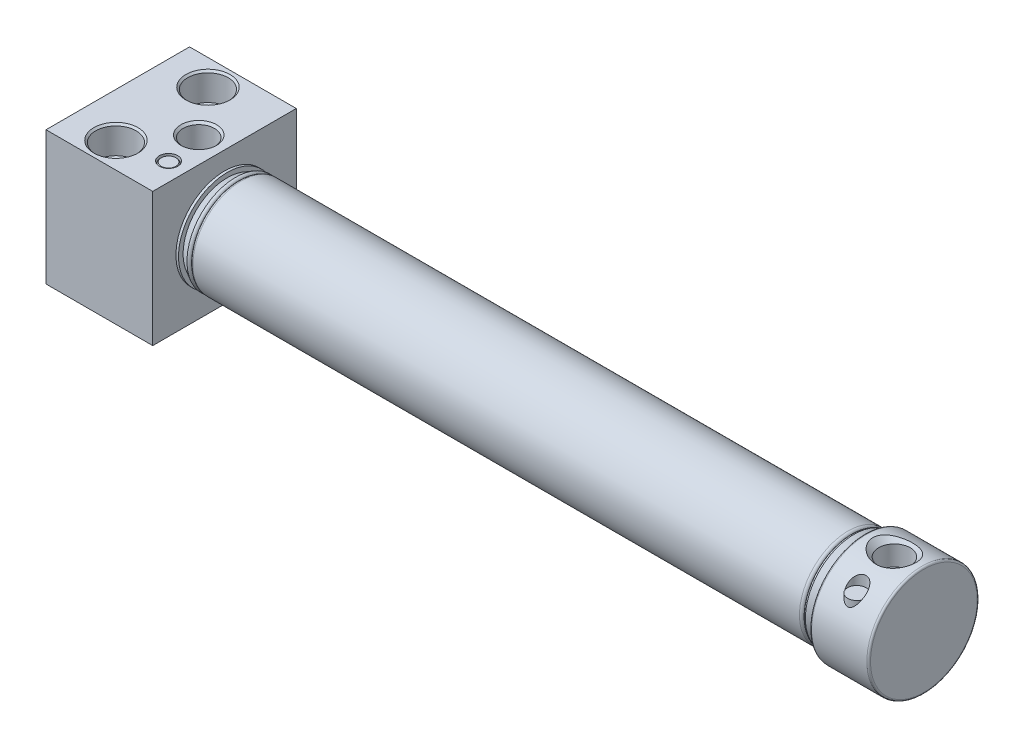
ISO-10303-21;
HEADER;
FILE_DESCRIPTION(('STEP AP214'),'2;1');
FILE_NAME('part.step','',(''),(''),'','','');
FILE_SCHEMA(('AUTOMOTIVE_DESIGN { 1 0 10303 214 1 1 1 1 }'));
ENDSEC;
DATA;
#1=APPLICATION_CONTEXT('core data for automotive mechanical design processes');
#2=APPLICATION_PROTOCOL_DEFINITION('international standard','automotive_design',2000,#1);
#3=PRODUCT_CONTEXT('',#1,'mechanical');
#4=PRODUCT('Part','Part','',(#3));
#5=PRODUCT_RELATED_PRODUCT_CATEGORY('part','',(#4));
#6=PRODUCT_DEFINITION_FORMATION('','',#4);
#7=PRODUCT_DEFINITION_CONTEXT('part definition',#1,'design');
#8=PRODUCT_DEFINITION('design','',#6,#7);
#9=PRODUCT_DEFINITION_SHAPE('','',#8);
#10=(LENGTH_UNIT() NAMED_UNIT(*) SI_UNIT(.MILLI.,.METRE.));
#11=(NAMED_UNIT(*) PLANE_ANGLE_UNIT() SI_UNIT($,.RADIAN.));
#12=(NAMED_UNIT(*) SI_UNIT($,.STERADIAN.) SOLID_ANGLE_UNIT());
#13=UNCERTAINTY_MEASURE_WITH_UNIT(LENGTH_MEASURE(1.E-05),#10,'distance_accuracy_value','');
#14=(GEOMETRIC_REPRESENTATION_CONTEXT(3) GLOBAL_UNCERTAINTY_ASSIGNED_CONTEXT((#13)) GLOBAL_UNIT_ASSIGNED_CONTEXT((#10,
#11,#12)) REPRESENTATION_CONTEXT('',''));
#15=CARTESIAN_POINT('',(0.,0.,0.));
#16=DIRECTION('',(0.,0.,1.));
#17=DIRECTION('',(1.,0.,0.));
#18=AXIS2_PLACEMENT_3D('',#15,#16,#17);
#19=CARTESIAN_POINT('',(29.,18.15,-19.5));
#20=DIRECTION('',(0.,-1.,0.));
#21=DIRECTION('',(0.,0.,-1.));
#22=AXIS2_PLACEMENT_3D('',#19,#20,#21);
#23=PLANE('',#22);
#24=DIRECTION('',(0.,0.,1.));
#25=VECTOR('',#24,1.);
#26=CARTESIAN_POINT('',(0.,18.15,-19.5));
#27=LINE('',#26,#25);
#28=CARTESIAN_POINT('',(0.,18.15,-19.5));
#29=VERTEX_POINT('',#28);
#30=CARTESIAN_POINT('',(0.,18.15,19.5));
#31=VERTEX_POINT('',#30);
#32=EDGE_CURVE('E256',#29,#31,#27,.T.);
#33=ORIENTED_EDGE('',*,*,#32,.T.);
#34=DIRECTION('',(-1.,0.,0.));
#35=VECTOR('',#34,1.);
#36=CARTESIAN_POINT('',(29.,18.15,19.5));
#37=LINE('',#36,#35);
#38=CARTESIAN_POINT('',(29.,18.15,19.5));
#39=VERTEX_POINT('',#38);
#40=EDGE_CURVE('E277',#39,#31,#37,.T.);
#41=ORIENTED_EDGE('',*,*,#40,.F.);
#42=DIRECTION('',(0.,0.,1.));
#43=VECTOR('',#42,1.);
#44=CARTESIAN_POINT('',(29.,18.15,-19.5));
#45=LINE('',#44,#43);
#46=CARTESIAN_POINT('',(29.,18.15,-19.5));
#47=VERTEX_POINT('',#46);
#48=EDGE_CURVE('E257',#47,#39,#45,.T.);
#49=ORIENTED_EDGE('',*,*,#48,.F.);
#50=DIRECTION('',(-1.,0.,0.));
#51=VECTOR('',#50,1.);
#52=CARTESIAN_POINT('',(29.,18.15,-19.5));
#53=LINE('',#52,#51);
#54=EDGE_CURVE('E263',#47,#29,#53,.T.);
#55=ORIENTED_EDGE('',*,*,#54,.T.);
#56=EDGE_LOOP('',(#33,#41,#49,#55));
#57=FACE_BOUND('',#56,.T.);
#58=CARTESIAN_POINT('',(12.,18.15,-12.5));
#59=DIRECTION('',(0.,-1.,0.));
#60=DIRECTION('',(0.,0.,-1.));
#61=AXIS2_PLACEMENT_3D('',#58,#59,#60);
#62=CIRCLE('',#61,6.);
#63=CARTESIAN_POINT('',(12.,18.15,-18.5));
#64=VERTEX_POINT('',#63);
#65=EDGE_CURVE('E253',#64,#64,#62,.T.);
#66=ORIENTED_EDGE('',*,*,#65,.T.);
#67=EDGE_LOOP('',(#66));
#68=FACE_BOUND('',#67,.T.);
#69=CARTESIAN_POINT('',(12.,18.15,12.5));
#70=DIRECTION('',(0.,-1.,0.));
#71=DIRECTION('',(0.,0.,-1.));
#72=AXIS2_PLACEMENT_3D('',#69,#70,#71);
#73=CIRCLE('',#72,6.);
#74=CARTESIAN_POINT('',(12.,18.15,6.5));
#75=VERTEX_POINT('',#74);
#76=EDGE_CURVE('E232',#75,#75,#73,.T.);
#77=ORIENTED_EDGE('',*,*,#76,.T.);
#78=EDGE_LOOP('',(#77));
#79=FACE_BOUND('',#78,.T.);
#80=CARTESIAN_POINT('',(22.,18.15,0.));
#81=DIRECTION('',(0.,-1.,0.));
#82=DIRECTION('',(0.,0.,-1.));
#83=AXIS2_PLACEMENT_3D('',#80,#81,#82);
#84=CIRCLE('',#83,4.864);
#85=CARTESIAN_POINT('',(22.,18.15,-4.864));
#86=VERTEX_POINT('',#85);
#87=EDGE_CURVE('E211',#86,#86,#84,.T.);
#88=ORIENTED_EDGE('',*,*,#87,.T.);
#89=EDGE_LOOP('',(#88));
#90=FACE_BOUND('',#89,.T.);
#91=CARTESIAN_POINT('',(24.,18.15,10.2));
#92=DIRECTION('',(0.,-1.,0.));
#93=DIRECTION('',(0.,0.,-1.));
#94=AXIS2_PLACEMENT_3D('',#91,#92,#93);
#95=CIRCLE('',#94,2.5);
#96=CARTESIAN_POINT('',(24.,18.15,7.7));
#97=VERTEX_POINT('',#96);
#98=EDGE_CURVE('E201',#97,#97,#95,.T.);
#99=ORIENTED_EDGE('',*,*,#98,.T.);
#100=EDGE_LOOP('',(#99));
#101=FACE_BOUND('',#100,.T.);
#102=ADVANCED_FACE('F17',(#57,#68,#79,#90,#101),#23,.F.);
#103=CARTESIAN_POINT('',(29.,18.15,19.5));
#104=DIRECTION('',(0.,0.,-1.));
#105=DIRECTION('',(-1.,0.,0.));
#106=AXIS2_PLACEMENT_3D('',#103,#104,#105);
#107=PLANE('',#106);
#108=DIRECTION('',(0.,-1.,0.));
#109=VECTOR('',#108,1.);
#110=CARTESIAN_POINT('',(0.,18.15,19.5));
#111=LINE('',#110,#109);
#112=CARTESIAN_POINT('',(0.,-18.15,19.5));
#113=VERTEX_POINT('',#112);
#114=EDGE_CURVE('E266',#31,#113,#111,.T.);
#115=ORIENTED_EDGE('',*,*,#114,.T.);
#116=DIRECTION('',(-1.,0.,0.));
#117=VECTOR('',#116,1.);
#118=CARTESIAN_POINT('',(29.,-18.15,19.5));
#119=LINE('',#118,#117);
#120=CARTESIAN_POINT('',(29.,-18.15,19.5));
#121=VERTEX_POINT('',#120);
#122=EDGE_CURVE('E274',#121,#113,#119,.T.);
#123=ORIENTED_EDGE('',*,*,#122,.F.);
#124=DIRECTION('',(0.,-1.,0.));
#125=VECTOR('',#124,1.);
#126=CARTESIAN_POINT('',(29.,18.15,19.5));
#127=LINE('',#126,#125);
#128=EDGE_CURVE('E76',#39,#121,#127,.T.);
#129=ORIENTED_EDGE('',*,*,#128,.F.);
#130=ORIENTED_EDGE('',*,*,#40,.T.);
#131=EDGE_LOOP('',(#115,#123,#129,#130));
#132=FACE_BOUND('',#131,.T.);
#133=ADVANCED_FACE('F318',(#132),#107,.F.);
#134=CARTESIAN_POINT('',(29.,-18.15,19.5));
#135=DIRECTION('',(0.,1.,0.));
#136=DIRECTION('',(0.,0.,1.));
#137=AXIS2_PLACEMENT_3D('',#134,#135,#136);
#138=PLANE('',#137);
#139=CARTESIAN_POINT('',(12.,-18.15,12.5));
#140=DIRECTION('',(0.,-1.,0.));
#141=DIRECTION('',(0.,0.,-1.));
#142=AXIS2_PLACEMENT_3D('',#139,#140,#141);
#143=CIRCLE('',#142,3.8);
#144=CARTESIAN_POINT('',(12.,-18.15,8.7));
#145=VERTEX_POINT('',#144);
#146=EDGE_CURVE('E214',#145,#145,#143,.T.);
#147=ORIENTED_EDGE('',*,*,#146,.F.);
#148=EDGE_LOOP('',(#147));
#149=FACE_BOUND('',#148,.T.);
#150=CARTESIAN_POINT('',(12.,-18.15,-12.5));
#151=DIRECTION('',(0.,-1.,0.));
#152=DIRECTION('',(0.,0.,-1.));
#153=AXIS2_PLACEMENT_3D('',#150,#151,#152);
#154=CIRCLE('',#153,3.8);
#155=CARTESIAN_POINT('',(12.,-18.15,-16.3));
#156=VERTEX_POINT('',#155);
#157=EDGE_CURVE('E235',#156,#156,#154,.T.);
#158=ORIENTED_EDGE('',*,*,#157,.F.);
#159=EDGE_LOOP('',(#158));
#160=FACE_BOUND('',#159,.T.);
#161=DIRECTION('',(0.,0.,-1.));
#162=VECTOR('',#161,1.);
#163=CARTESIAN_POINT('',(0.,-18.15,19.5));
#164=LINE('',#163,#162);
#165=CARTESIAN_POINT('',(0.,-18.15,-19.5));
#166=VERTEX_POINT('',#165);
#167=EDGE_CURVE('E268',#113,#166,#164,.T.);
#168=ORIENTED_EDGE('',*,*,#167,.T.);
#169=DIRECTION('',(-1.,0.,0.));
#170=VECTOR('',#169,1.);
#171=CARTESIAN_POINT('',(29.,-18.15,-19.5));
#172=LINE('',#171,#170);
#173=CARTESIAN_POINT('',(29.,-18.15,-19.5));
#174=VERTEX_POINT('',#173);
#175=EDGE_CURVE('E272',#174,#166,#172,.T.);
#176=ORIENTED_EDGE('',*,*,#175,.F.);
#177=DIRECTION('',(0.,0.,-1.));
#178=VECTOR('',#177,1.);
#179=CARTESIAN_POINT('',(29.,-18.15,19.5));
#180=LINE('',#179,#178);
#181=EDGE_CURVE('E260',#121,#174,#180,.T.);
#182=ORIENTED_EDGE('',*,*,#181,.F.);
#183=ORIENTED_EDGE('',*,*,#122,.T.);
#184=EDGE_LOOP('',(#168,#176,#182,#183));
#185=FACE_BOUND('',#184,.T.);
#186=ADVANCED_FACE('F324',(#149,#160,#185),#138,.F.);
#187=CARTESIAN_POINT('',(29.,-18.15,-19.5));
#188=DIRECTION('',(0.,0.,1.));
#189=DIRECTION('',(1.,0.,0.));
#190=AXIS2_PLACEMENT_3D('',#187,#188,#189);
#191=PLANE('',#190);
#192=DIRECTION('',(0.,1.,0.));
#193=VECTOR('',#192,1.);
#194=CARTESIAN_POINT('',(0.,-18.15,-19.5));
#195=LINE('',#194,#193);
#196=EDGE_CURVE('E68',#166,#29,#195,.T.);
#197=ORIENTED_EDGE('',*,*,#196,.T.);
#198=ORIENTED_EDGE('',*,*,#54,.F.);
#199=DIRECTION('',(0.,1.,0.));
#200=VECTOR('',#199,1.);
#201=CARTESIAN_POINT('',(29.,-18.15,-19.5));
#202=LINE('',#201,#200);
#203=EDGE_CURVE('E47',#174,#47,#202,.T.);
#204=ORIENTED_EDGE('',*,*,#203,.F.);
#205=ORIENTED_EDGE('',*,*,#175,.T.);
#206=EDGE_LOOP('',(#197,#198,#204,#205));
#207=FACE_BOUND('',#206,.T.);
#208=ADVANCED_FACE('F471',(#207),#191,.F.);
#209=CARTESIAN_POINT('',(29.,0.,0.));
#210=DIRECTION('',(1.,0.,0.));
#211=DIRECTION('',(0.,0.,-1.));
#212=AXIS2_PLACEMENT_3D('',#209,#210,#211);
#213=PLANE('',#212);
#214=CARTESIAN_POINT('',(29.,0.,0.));
#215=DIRECTION('',(1.,0.,0.));
#216=DIRECTION('',(0.,0.,-1.));
#217=AXIS2_PLACEMENT_3D('',#214,#215,#216);
#218=CIRCLE('',#217,13.2);
#219=CARTESIAN_POINT('',(29.,0.,-13.2));
#220=VERTEX_POINT('',#219);
#221=EDGE_CURVE('E31',#220,#220,#218,.T.);
#222=ORIENTED_EDGE('',*,*,#221,.F.);
#223=EDGE_LOOP('',(#222));
#224=FACE_BOUND('',#223,.T.);
#225=ORIENTED_EDGE('',*,*,#48,.T.);
#226=ORIENTED_EDGE('',*,*,#128,.T.);
#227=ORIENTED_EDGE('',*,*,#181,.T.);
#228=ORIENTED_EDGE('',*,*,#203,.T.);
#229=EDGE_LOOP('',(#225,#226,#227,#228));
#230=FACE_BOUND('',#229,.T.);
#231=ADVANCED_FACE('F465',(#224,#230),#213,.T.);
#232=CARTESIAN_POINT('',(0.,0.,0.));
#233=DIRECTION('',(1.,0.,0.));
#234=DIRECTION('',(0.,0.,-1.));
#235=AXIS2_PLACEMENT_3D('',#232,#233,#234);
#236=PLANE('',#235);
#237=CARTESIAN_POINT('',(0.,0.,0.));
#238=DIRECTION('',(1.,0.,0.));
#239=DIRECTION('',(0.,0.,-1.));
#240=AXIS2_PLACEMENT_3D('',#237,#238,#239);
#241=CIRCLE('',#240,13.);
#242=CARTESIAN_POINT('',(0.,0.,-13.));
#243=VERTEX_POINT('',#242);
#244=EDGE_CURVE('E180',#243,#243,#241,.T.);
#245=ORIENTED_EDGE('',*,*,#244,.T.);
#246=EDGE_LOOP('',(#245));
#247=FACE_BOUND('',#246,.T.);
#248=ORIENTED_EDGE('',*,*,#32,.F.);
#249=ORIENTED_EDGE('',*,*,#196,.F.);
#250=ORIENTED_EDGE('',*,*,#167,.F.);
#251=ORIENTED_EDGE('',*,*,#114,.F.);
#252=EDGE_LOOP('',(#248,#249,#250,#251));
#253=FACE_BOUND('',#252,.T.);
#254=ADVANCED_FACE('F470',(#247,#253),#236,.F.);
#255=CARTESIAN_POINT('',(12.,17.65,-12.5));
#256=DIRECTION('',(0.,1.,0.));
#257=DIRECTION('',(0.,0.,1.));
#258=AXIS2_PLACEMENT_3D('',#255,#256,#257);
#259=CONICAL_SURFACE('',#258,5.5,0.785398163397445);
#260=ORIENTED_EDGE('',*,*,#65,.F.);
#261=EDGE_LOOP('',(#260));
#262=FACE_BOUND('',#261,.T.);
#263=CARTESIAN_POINT('',(12.,17.65,-12.5));
#264=DIRECTION('',(0.,-1.,0.));
#265=DIRECTION('',(0.,0.,-1.));
#266=AXIS2_PLACEMENT_3D('',#263,#264,#265);
#267=CIRCLE('',#266,5.5);
#268=CARTESIAN_POINT('',(12.,17.65,-18.));
#269=VERTEX_POINT('',#268);
#270=EDGE_CURVE('E250',#269,#269,#267,.T.);
#271=ORIENTED_EDGE('',*,*,#270,.T.);
#272=EDGE_LOOP('',(#271));
#273=FACE_BOUND('',#272,.T.);
#274=ADVANCED_FACE('F824',(#262,#273),#259,.F.);
#275=CARTESIAN_POINT('',(12.,-18.15,-12.5));
#276=DIRECTION('',(0.,-1.,0.));
#277=DIRECTION('',(0.,0.,-1.));
#278=AXIS2_PLACEMENT_3D('',#275,#276,#277);
#279=CYLINDRICAL_SURFACE('',#278,5.5);
#280=ORIENTED_EDGE('',*,*,#270,.F.);
#281=EDGE_LOOP('',(#280));
#282=FACE_BOUND('',#281,.T.);
#283=CARTESIAN_POINT('',(12.,10.65,-12.5));
#284=DIRECTION('',(0.,-1.,0.));
#285=DIRECTION('',(0.,0.,-1.));
#286=AXIS2_PLACEMENT_3D('',#283,#284,#285);
#287=CIRCLE('',#286,5.5);
#288=CARTESIAN_POINT('',(12.,10.65,-18.));
#289=VERTEX_POINT('',#288);
#290=EDGE_CURVE('E247',#289,#289,#287,.T.);
#291=ORIENTED_EDGE('',*,*,#290,.T.);
#292=EDGE_LOOP('',(#291));
#293=FACE_BOUND('',#292,.T.);
#294=ADVANCED_FACE('F829',(#282,#293),#279,.F.);
#295=CARTESIAN_POINT('',(12.,10.65,-18.));
#296=DIRECTION('',(0.,-1.,0.));
#297=DIRECTION('',(0.,0.,-1.));
#298=AXIS2_PLACEMENT_3D('',#295,#296,#297);
#299=PLANE('',#298);
#300=ORIENTED_EDGE('',*,*,#290,.F.);
#301=EDGE_LOOP('',(#300));
#302=FACE_BOUND('',#301,.T.);
#303=CARTESIAN_POINT('',(12.,10.65,-12.5));
#304=DIRECTION('',(0.,-1.,0.));
#305=DIRECTION('',(0.,0.,-1.));
#306=AXIS2_PLACEMENT_3D('',#303,#304,#305);
#307=CIRCLE('',#306,3.8);
#308=CARTESIAN_POINT('',(12.,10.65,-16.3));
#309=VERTEX_POINT('',#308);
#310=EDGE_CURVE('E244',#309,#309,#307,.T.);
#311=ORIENTED_EDGE('',*,*,#310,.T.);
#312=EDGE_LOOP('',(#311));
#313=FACE_BOUND('',#312,.T.);
#314=ADVANCED_FACE('F801',(#302,#313),#299,.F.);
#315=CARTESIAN_POINT('',(12.,10.15,-12.5));
#316=DIRECTION('',(0.,1.,0.));
#317=DIRECTION('',(0.,0.,1.));
#318=AXIS2_PLACEMENT_3D('',#315,#316,#317);
#319=CONICAL_SURFACE('',#318,3.3,0.785398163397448);
#320=ORIENTED_EDGE('',*,*,#310,.F.);
#321=EDGE_LOOP('',(#320));
#322=FACE_BOUND('',#321,.T.);
#323=CARTESIAN_POINT('',(12.,10.15,-12.5));
#324=DIRECTION('',(0.,-1.,0.));
#325=DIRECTION('',(0.,0.,-1.));
#326=AXIS2_PLACEMENT_3D('',#323,#324,#325);
#327=CIRCLE('',#326,3.3);
#328=CARTESIAN_POINT('',(12.,10.15,-15.8));
#329=VERTEX_POINT('',#328);
#330=EDGE_CURVE('E241',#329,#329,#327,.T.);
#331=ORIENTED_EDGE('',*,*,#330,.T.);
#332=EDGE_LOOP('',(#331));
#333=FACE_BOUND('',#332,.T.);
#334=ADVANCED_FACE('F796',(#322,#333),#319,.F.);
#335=CARTESIAN_POINT('',(12.,-18.15,-12.5));
#336=DIRECTION('',(0.,-1.,0.));
#337=DIRECTION('',(0.,0.,-1.));
#338=AXIS2_PLACEMENT_3D('',#335,#336,#337);
#339=CYLINDRICAL_SURFACE('',#338,3.3);
#340=ORIENTED_EDGE('',*,*,#330,.F.);
#341=EDGE_LOOP('',(#340));
#342=FACE_BOUND('',#341,.T.);
#343=CARTESIAN_POINT('',(12.,-17.65,-12.5));
#344=DIRECTION('',(0.,-1.,0.));
#345=DIRECTION('',(0.,0.,-1.));
#346=AXIS2_PLACEMENT_3D('',#343,#344,#345);
#347=CIRCLE('',#346,3.3);
#348=CARTESIAN_POINT('',(12.,-17.65,-15.8));
#349=VERTEX_POINT('',#348);
#350=EDGE_CURVE('E238',#349,#349,#347,.T.);
#351=ORIENTED_EDGE('',*,*,#350,.T.);
#352=EDGE_LOOP('',(#351));
#353=FACE_BOUND('',#352,.T.);
#354=ADVANCED_FACE('F766',(#342,#353),#339,.F.);
#355=CARTESIAN_POINT('',(12.,-18.15,-12.5));
#356=DIRECTION('',(0.,-1.,0.));
#357=DIRECTION('',(0.,0.,-1.));
#358=AXIS2_PLACEMENT_3D('',#355,#356,#357);
#359=CONICAL_SURFACE('',#358,3.8,0.785398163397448);
#360=ORIENTED_EDGE('',*,*,#350,.F.);
#361=EDGE_LOOP('',(#360));
#362=FACE_BOUND('',#361,.T.);
#363=ORIENTED_EDGE('',*,*,#157,.T.);
#364=EDGE_LOOP('',(#363));
#365=FACE_BOUND('',#364,.T.);
#366=ADVANCED_FACE('F728',(#362,#365),#359,.F.);
#367=CARTESIAN_POINT('',(12.,17.65,12.5));
#368=DIRECTION('',(0.,1.,0.));
#369=DIRECTION('',(0.,0.,1.));
#370=AXIS2_PLACEMENT_3D('',#367,#368,#369);
#371=CONICAL_SURFACE('',#370,5.5,0.785398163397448);
#372=ORIENTED_EDGE('',*,*,#76,.F.);
#373=EDGE_LOOP('',(#372));
#374=FACE_BOUND('',#373,.T.);
#375=CARTESIAN_POINT('',(12.,17.65,12.5));
#376=DIRECTION('',(0.,-1.,0.));
#377=DIRECTION('',(0.,0.,-1.));
#378=AXIS2_PLACEMENT_3D('',#375,#376,#377);
#379=CIRCLE('',#378,5.5);
#380=CARTESIAN_POINT('',(12.,17.65,7.));
#381=VERTEX_POINT('',#380);
#382=EDGE_CURVE('E229',#381,#381,#379,.T.);
#383=ORIENTED_EDGE('',*,*,#382,.T.);
#384=EDGE_LOOP('',(#383));
#385=FACE_BOUND('',#384,.T.);
#386=ADVANCED_FACE('F722',(#374,#385),#371,.F.);
#387=CARTESIAN_POINT('',(12.,-18.15,12.5));
#388=DIRECTION('',(0.,-1.,0.));
#389=DIRECTION('',(0.,0.,-1.));
#390=AXIS2_PLACEMENT_3D('',#387,#388,#389);
#391=CYLINDRICAL_SURFACE('',#390,5.5);
#392=ORIENTED_EDGE('',*,*,#382,.F.);
#393=EDGE_LOOP('',(#392));
#394=FACE_BOUND('',#393,.T.);
#395=CARTESIAN_POINT('',(12.,10.65,12.5));
#396=DIRECTION('',(0.,-1.,0.));
#397=DIRECTION('',(0.,0.,-1.));
#398=AXIS2_PLACEMENT_3D('',#395,#396,#397);
#399=CIRCLE('',#398,5.5);
#400=CARTESIAN_POINT('',(12.,10.65,7.));
#401=VERTEX_POINT('',#400);
#402=EDGE_CURVE('E226',#401,#401,#399,.T.);
#403=ORIENTED_EDGE('',*,*,#402,.T.);
#404=EDGE_LOOP('',(#403));
#405=FACE_BOUND('',#404,.T.);
#406=ADVANCED_FACE('F727',(#394,#405),#391,.F.);
#407=CARTESIAN_POINT('',(12.,10.65,7.));
#408=DIRECTION('',(0.,-1.,0.));
#409=DIRECTION('',(0.,0.,-1.));
#410=AXIS2_PLACEMENT_3D('',#407,#408,#409);
#411=PLANE('',#410);
#412=ORIENTED_EDGE('',*,*,#402,.F.);
#413=EDGE_LOOP('',(#412));
#414=FACE_BOUND('',#413,.T.);
#415=CARTESIAN_POINT('',(12.,10.65,12.5));
#416=DIRECTION('',(0.,-1.,0.));
#417=DIRECTION('',(0.,0.,-1.));
#418=AXIS2_PLACEMENT_3D('',#415,#416,#417);
#419=CIRCLE('',#418,3.8);
#420=CARTESIAN_POINT('',(12.,10.65,8.7));
#421=VERTEX_POINT('',#420);
#422=EDGE_CURVE('E223',#421,#421,#419,.T.);
#423=ORIENTED_EDGE('',*,*,#422,.T.);
#424=EDGE_LOOP('',(#423));
#425=FACE_BOUND('',#424,.T.);
#426=ADVANCED_FACE('F700',(#414,#425),#411,.F.);
#427=CARTESIAN_POINT('',(12.,10.15,12.5));
#428=DIRECTION('',(0.,1.,0.));
#429=DIRECTION('',(0.,0.,1.));
#430=AXIS2_PLACEMENT_3D('',#427,#428,#429);
#431=CONICAL_SURFACE('',#430,3.3,0.785398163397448);
#432=ORIENTED_EDGE('',*,*,#422,.F.);
#433=EDGE_LOOP('',(#432));
#434=FACE_BOUND('',#433,.T.);
#435=CARTESIAN_POINT('',(12.,10.15,12.5));
#436=DIRECTION('',(0.,-1.,0.));
#437=DIRECTION('',(0.,0.,-1.));
#438=AXIS2_PLACEMENT_3D('',#435,#436,#437);
#439=CIRCLE('',#438,3.3);
#440=CARTESIAN_POINT('',(12.,10.15,9.2));
#441=VERTEX_POINT('',#440);
#442=EDGE_CURVE('E220',#441,#441,#439,.T.);
#443=ORIENTED_EDGE('',*,*,#442,.T.);
#444=EDGE_LOOP('',(#443));
#445=FACE_BOUND('',#444,.T.);
#446=ADVANCED_FACE('F695',(#434,#445),#431,.F.);
#447=CARTESIAN_POINT('',(12.,-18.15,12.5));
#448=DIRECTION('',(0.,-1.,0.));
#449=DIRECTION('',(0.,0.,-1.));
#450=AXIS2_PLACEMENT_3D('',#447,#448,#449);
#451=CYLINDRICAL_SURFACE('',#450,3.3);
#452=ORIENTED_EDGE('',*,*,#442,.F.);
#453=EDGE_LOOP('',(#452));
#454=FACE_BOUND('',#453,.T.);
#455=CARTESIAN_POINT('',(12.,-17.65,12.5));
#456=DIRECTION('',(0.,-1.,0.));
#457=DIRECTION('',(0.,0.,-1.));
#458=AXIS2_PLACEMENT_3D('',#455,#456,#457);
#459=CIRCLE('',#458,3.3);
#460=CARTESIAN_POINT('',(12.,-17.65,9.2));
#461=VERTEX_POINT('',#460);
#462=EDGE_CURVE('E217',#461,#461,#459,.T.);
#463=ORIENTED_EDGE('',*,*,#462,.T.);
#464=EDGE_LOOP('',(#463));
#465=FACE_BOUND('',#464,.T.);
#466=ADVANCED_FACE('F663',(#454,#465),#451,.F.);
#467=CARTESIAN_POINT('',(12.,-18.15,12.5));
#468=DIRECTION('',(0.,-1.,0.));
#469=DIRECTION('',(0.,0.,-1.));
#470=AXIS2_PLACEMENT_3D('',#467,#468,#469);
#471=CONICAL_SURFACE('',#470,3.8,0.785398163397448);
#472=ORIENTED_EDGE('',*,*,#462,.F.);
#473=EDGE_LOOP('',(#472));
#474=FACE_BOUND('',#473,.T.);
#475=ORIENTED_EDGE('',*,*,#146,.T.);
#476=EDGE_LOOP('',(#475));
#477=FACE_BOUND('',#476,.T.);
#478=ADVANCED_FACE('F621',(#474,#477),#471,.F.);
#479=CARTESIAN_POINT('',(22.,17.569,0.));
#480=DIRECTION('',(0.,1.,0.));
#481=DIRECTION('',(0.,0.,1.));
#482=AXIS2_PLACEMENT_3D('',#479,#480,#481);
#483=CONICAL_SURFACE('',#482,4.283,0.785398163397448);
#484=ORIENTED_EDGE('',*,*,#87,.F.);
#485=EDGE_LOOP('',(#484));
#486=FACE_BOUND('',#485,.T.);
#487=CARTESIAN_POINT('',(22.,17.569,0.));
#488=DIRECTION('',(0.,-1.,0.));
#489=DIRECTION('',(0.,0.,-1.));
#490=AXIS2_PLACEMENT_3D('',#487,#488,#489);
#491=CIRCLE('',#490,4.283);
#492=CARTESIAN_POINT('',(22.,17.569,-4.283));
#493=VERTEX_POINT('',#492);
#494=EDGE_CURVE('E208',#493,#493,#491,.T.);
#495=ORIENTED_EDGE('',*,*,#494,.T.);
#496=EDGE_LOOP('',(#495));
#497=FACE_BOUND('',#496,.T.);
#498=ADVANCED_FACE('F425',(#486,#497),#483,.F.);
#499=CARTESIAN_POINT('',(22.,0.,0.));
#500=DIRECTION('',(0.,-1.,0.));
#501=DIRECTION('',(0.,0.,-1.));
#502=AXIS2_PLACEMENT_3D('',#499,#500,#501);
#503=CYLINDRICAL_SURFACE('',#502,4.283);
#504=ORIENTED_EDGE('',*,*,#494,.F.);
#505=EDGE_LOOP('',(#504));
#506=FACE_BOUND('',#505,.T.);
#507=CARTESIAN_POINT('',(22.,10.15,0.));
#508=DIRECTION('',(0.,-1.,0.));
#509=DIRECTION('',(0.,0.,-1.));
#510=AXIS2_PLACEMENT_3D('',#507,#508,#509);
#511=CIRCLE('',#510,4.283);
#512=CARTESIAN_POINT('',(22.,10.15,-4.283));
#513=VERTEX_POINT('',#512);
#514=EDGE_CURVE('E205',#513,#513,#511,.T.);
#515=ORIENTED_EDGE('',*,*,#514,.T.);
#516=EDGE_LOOP('',(#515));
#517=FACE_BOUND('',#516,.T.);
#518=ADVANCED_FACE('F421',(#506,#517),#503,.F.);
#519=CARTESIAN_POINT('',(26.283,10.15,0.));
#520=DIRECTION('',(0.,-1.,0.));
#521=DIRECTION('',(0.,0.,-1.));
#522=AXIS2_PLACEMENT_3D('',#519,#520,#521);
#523=PLANE('',#522);
#524=ORIENTED_EDGE('',*,*,#514,.F.);
#525=EDGE_LOOP('',(#524));
#526=FACE_BOUND('',#525,.T.);
#527=CARTESIAN_POINT('',(22.,10.15,0.));
#528=DIRECTION('',(0.,-1.,0.));
#529=DIRECTION('',(0.,0.,-1.));
#530=AXIS2_PLACEMENT_3D('',#527,#528,#529);
#531=CIRCLE('',#530,1.5);
#532=CARTESIAN_POINT('',(22.,10.15,-1.5));
#533=VERTEX_POINT('',#532);
#534=EDGE_CURVE('E202',#533,#533,#531,.T.);
#535=ORIENTED_EDGE('',*,*,#534,.T.);
#536=EDGE_LOOP('',(#535));
#537=FACE_BOUND('',#536,.T.);
#538=ADVANCED_FACE('F350',(#526,#537),#523,.F.);
#539=CARTESIAN_POINT('',(22.,0.,0.));
#540=DIRECTION('',(0.,-1.,0.));
#541=DIRECTION('',(0.,0.,-1.));
#542=AXIS2_PLACEMENT_3D('',#539,#540,#541);
#543=CYLINDRICAL_SURFACE('',#542,1.5);
#544=CARTESIAN_POINT('',(22.,6.32455532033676,-1.5));
#545=CARTESIAN_POINT('',(22.0830429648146,6.3245569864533,-1.49999731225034));
#546=CARTESIAN_POINT('',(22.1661172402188,6.32620871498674,-1.49308039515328));
#547=CARTESIAN_POINT('',(22.3298947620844,6.33262329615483,-1.46563082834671));
#548=CARTESIAN_POINT('',(22.4105963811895,6.33738823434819,-1.44508905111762));
#549=CARTESIAN_POINT('',(22.5672359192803,6.34946149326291,-1.39107808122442));
#550=CARTESIAN_POINT('',(22.6431792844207,6.35676684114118,-1.3576239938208));
#551=CARTESIAN_POINT('',(22.7883798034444,6.37309417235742,-1.2787823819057));
#552=CARTESIAN_POINT('',(22.8576369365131,6.38211616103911,-1.23339482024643));
#553=CARTESIAN_POINT('',(22.9888002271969,6.40104967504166,-1.13106531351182));
#554=CARTESIAN_POINT('',(23.0505624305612,6.41097365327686,-1.07394112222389));
#555=CARTESIAN_POINT('',(23.1637191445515,6.43048432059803,-0.95015302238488));
#556=CARTESIAN_POINT('',(23.2151127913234,6.44007098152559,-0.883488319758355));
#557=CARTESIAN_POINT('',(23.3066502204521,6.45796329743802,-0.741538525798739));
#558=CARTESIAN_POINT('',(23.3466544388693,6.46625254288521,-0.666161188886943));
#559=CARTESIAN_POINT('',(23.4133728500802,6.4804748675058,-0.509529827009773));
#560=CARTESIAN_POINT('',(23.4400887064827,6.48640824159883,-0.428276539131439));
#561=CARTESIAN_POINT('',(23.4790161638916,6.49516228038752,-0.263698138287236));
#562=CARTESIAN_POINT('',(23.4914717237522,6.49803523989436,-0.180433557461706));
#563=CARTESIAN_POINT('',(23.5022888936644,6.50052632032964,-0.0129504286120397));
#564=CARTESIAN_POINT('',(23.5006522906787,6.50014485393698,0.0712679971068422));
#565=CARTESIAN_POINT('',(23.4835109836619,6.49620964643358,0.236582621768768));
#566=CARTESIAN_POINT('',(23.4682693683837,6.49271608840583,0.317707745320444));
#567=CARTESIAN_POINT('',(23.4247712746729,6.48301834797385,0.476216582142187));
#568=CARTESIAN_POINT('',(23.3965141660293,6.4768140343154,0.553600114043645));
#569=CARTESIAN_POINT('',(23.3275619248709,6.46229685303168,0.703145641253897));
#570=CARTESIAN_POINT('',(23.2867693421,6.45396755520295,0.775261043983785));
#571=CARTESIAN_POINT('',(23.1939772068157,6.43611015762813,0.911717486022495));
#572=CARTESIAN_POINT('',(23.141975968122,6.42658187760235,0.976057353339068));
#573=CARTESIAN_POINT('',(23.0268182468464,6.40711077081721,1.09670294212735));
#574=CARTESIAN_POINT('',(22.9634315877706,6.39716345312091,1.15278844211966));
#575=CARTESIAN_POINT('',(22.828048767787,6.37818005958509,1.25357772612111));
#576=CARTESIAN_POINT('',(22.7560523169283,6.36914401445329,1.29828112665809));
#577=CARTESIAN_POINT('',(22.6051097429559,6.35299268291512,1.375150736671));
#578=CARTESIAN_POINT('',(22.5261394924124,6.34588444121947,1.40727114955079));
#579=CARTESIAN_POINT('',(22.363718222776,6.33448805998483,1.45771632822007));
#580=CARTESIAN_POINT('',(22.2802680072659,6.3301994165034,1.47604355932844));
#581=CARTESIAN_POINT('',(22.1132790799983,6.3250317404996,1.49803182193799));
#582=CARTESIAN_POINT('',(22.0297851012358,6.32407774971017,1.5020153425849));
#583=CARTESIAN_POINT('',(21.863325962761,6.32548450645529,1.49607984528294));
#584=CARTESIAN_POINT('',(21.7803607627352,6.32784499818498,1.48616190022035));
#585=CARTESIAN_POINT('',(21.6184644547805,6.33554357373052,1.45298594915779));
#586=CARTESIAN_POINT('',(21.5394940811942,6.34084115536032,1.42990927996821));
#587=CARTESIAN_POINT('',(21.3865412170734,6.35377976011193,1.37126901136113));
#588=CARTESIAN_POINT('',(21.3125592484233,6.36142102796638,1.33570410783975));
#589=CARTESIAN_POINT('',(21.1702984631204,6.3783481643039,1.25239967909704));
#590=CARTESIAN_POINT('',(21.1021378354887,6.38765975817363,1.20446365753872));
#591=CARTESIAN_POINT('',(20.974709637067,6.40681231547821,1.09803158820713));
#592=CARTESIAN_POINT('',(20.9154433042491,6.41665335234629,1.03953407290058));
#593=CARTESIAN_POINT('',(20.8062141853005,6.43600563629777,0.912172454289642));
#594=CARTESIAN_POINT('',(20.7564724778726,6.44550564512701,0.84311674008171));
#595=CARTESIAN_POINT('',(20.6692945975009,6.46288988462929,0.697443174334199));
#596=CARTESIAN_POINT('',(20.6318578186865,6.47077419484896,0.620825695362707));
#597=CARTESIAN_POINT('',(20.5706502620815,6.48399176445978,0.46270525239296));
#598=CARTESIAN_POINT('',(20.54678779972,6.48934209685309,0.381239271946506));
#599=CARTESIAN_POINT('',(20.5131234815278,6.49696306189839,0.215316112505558));
#600=CARTESIAN_POINT('',(20.5033193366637,6.4992341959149,0.13085942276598));
#601=CARTESIAN_POINT('',(20.4981625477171,6.50042390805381,-0.0365573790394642));
#602=CARTESIAN_POINT('',(20.502481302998,6.49941871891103,-0.119506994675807));
#603=CARTESIAN_POINT('',(20.5247061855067,6.49433417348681,-0.283464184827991));
#604=CARTESIAN_POINT('',(20.542612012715,6.49025488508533,-0.364471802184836));
#605=CARTESIAN_POINT('',(20.5913379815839,6.47948846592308,-0.521957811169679));
#606=CARTESIAN_POINT('',(20.6221067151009,6.47281172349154,-0.598452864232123));
#607=CARTESIAN_POINT('',(20.6956366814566,6.45755951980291,-0.745235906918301));
#608=CARTESIAN_POINT('',(20.7383992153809,6.448983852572,-0.815523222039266));
#609=CARTESIAN_POINT('',(20.8357487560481,6.43064181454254,-0.949482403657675));
#610=CARTESIAN_POINT('',(20.8905639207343,6.42085432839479,-1.01298558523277));
#611=CARTESIAN_POINT('',(21.0100087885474,6.40129818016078,-1.13000416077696));
#612=CARTESIAN_POINT('',(21.0746408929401,6.3915295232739,-1.1835171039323));
#613=CARTESIAN_POINT('',(21.2130719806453,6.37294956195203,-1.27982908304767));
#614=CARTESIAN_POINT('',(21.2869958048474,6.36415514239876,-1.32245215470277));
#615=CARTESIAN_POINT('',(21.4411478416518,6.34873668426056,-1.39460165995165));
#616=CARTESIAN_POINT('',(21.5213709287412,6.34211090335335,-1.42413861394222));
#617=CARTESIAN_POINT('',(21.6679991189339,6.33293595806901,-1.46432382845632));
#618=CARTESIAN_POINT('',(21.733640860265,6.32981507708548,-1.47767548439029));
#619=CARTESIAN_POINT('',(21.8661816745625,6.32562414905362,-1.49551438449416));
#620=CARTESIAN_POINT('',(21.9330806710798,6.32455397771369,-1.50000216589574));
#621=CARTESIAN_POINT('',(22.,6.32455532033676,-1.5));
#622=B_SPLINE_CURVE_WITH_KNOTS('',3,(#544,#545,#546,#547,#548,#549,#550,#551,#552,#553,#554,
#555,#556,#557,#558,#559,#560,#561,#562,#563,#564,#565,#566,#567,#568,#569,#570,#571,#572,#573,
#574,#575,#576,#577,#578,#579,#580,#581,#582,#583,#584,#585,#586,#587,#588,#589,#590,#591,#592,
#593,#594,#595,#596,#597,#598,#599,#600,#601,#602,#603,#604,#605,#606,#607,#608,#609,#610,#611,
#612,#613,#614,#615,#616,#617,#618,#619,#620,#621),.UNSPECIFIED.,.T.,.F.,(4,2,2,2,2,2,2,2,2,2,2,
2,2,2,2,2,2,2,2,2,2,2,2,2,2,2,2,2,2,2,2,2,2,2,2,2,2,2,4),(0.,0.248883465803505,
0.497933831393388,0.746693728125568,0.995454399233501,1.24841764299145,1.50140195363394,
1.75736456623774,2.01329512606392,2.26477865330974,2.5162302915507,2.7629223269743,
3.00962630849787,3.25829886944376,3.50700886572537,3.76147084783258,4.01594140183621,
4.27132969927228,4.52667233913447,4.77623696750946,5.02578233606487,5.27196914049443,
5.51818166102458,5.7685754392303,6.01900403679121,6.27468245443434,6.53034828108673,
6.78426611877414,7.03814260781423,7.28615450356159,7.53416092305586,7.78118549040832,
8.02823686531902,8.28044436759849,8.53271366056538,8.788832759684,9.04474558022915,
9.24531794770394,9.44587815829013),.UNSPECIFIED.);
#623=CARTESIAN_POINT('',(22.,6.32455532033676,-1.5));
#624=VERTEX_POINT('',#623);
#625=EDGE_CURVE('E129',#624,#624,#622,.T.);
#626=ORIENTED_EDGE('',*,*,#625,.T.);
#627=EDGE_LOOP('',(#626));
#628=FACE_BOUND('',#627,.T.);
#629=ORIENTED_EDGE('',*,*,#534,.F.);
#630=EDGE_LOOP('',(#629));
#631=FACE_BOUND('',#630,.T.);
#632=ADVANCED_FACE('F339',(#628,#631),#543,.F.);
#633=CARTESIAN_POINT('',(24.,18.15,10.2));
#634=DIRECTION('',(0.,1.,0.));
#635=DIRECTION('',(0.,0.,1.));
#636=AXIS2_PLACEMENT_3D('',#633,#634,#635);
#637=CYLINDRICAL_SURFACE('',#636,2.5);
#638=CARTESIAN_POINT('',(24.,15.4,10.2));
#639=DIRECTION('',(0.,1.,0.));
#640=DIRECTION('',(0.,0.,1.));
#641=AXIS2_PLACEMENT_3D('',#638,#639,#640);
#642=CIRCLE('',#641,2.5);
#643=CARTESIAN_POINT('',(24.,15.4,12.7));
#644=VERTEX_POINT('',#643);
#645=EDGE_CURVE('E189',#644,#644,#642,.T.);
#646=ORIENTED_EDGE('',*,*,#645,.F.);
#647=EDGE_LOOP('',(#646));
#648=FACE_BOUND('',#647,.T.);
#649=ORIENTED_EDGE('',*,*,#98,.F.);
#650=EDGE_LOOP('',(#649));
#651=FACE_BOUND('',#650,.T.);
#652=ADVANCED_FACE('F336',(#648,#651),#637,.F.);
#653=CARTESIAN_POINT('',(24.,17.9,10.2));
#654=DIRECTION('',(0.,-1.,0.));
#655=DIRECTION('',(0.,0.,-1.));
#656=AXIS2_PLACEMENT_3D('',#653,#654,#655);
#657=PLANE('',#656);
#658=CARTESIAN_POINT('',(24.,17.9,10.2));
#659=DIRECTION('',(0.,1.,0.));
#660=DIRECTION('',(0.,0.,1.));
#661=AXIS2_PLACEMENT_3D('',#658,#659,#660);
#662=CIRCLE('',#661,2.);
#663=CARTESIAN_POINT('',(24.,17.9,12.2));
#664=VERTEX_POINT('',#663);
#665=EDGE_CURVE('E198',#664,#664,#662,.T.);
#666=ORIENTED_EDGE('',*,*,#665,.T.);
#667=EDGE_LOOP('',(#666));
#668=FACE_BOUND('',#667,.T.);
#669=ADVANCED_FACE('F338',(#668),#657,.F.);
#670=CARTESIAN_POINT('',(24.,17.65,10.2));
#671=DIRECTION('',(0.,-1.,0.));
#672=DIRECTION('',(0.,0.,-1.));
#673=AXIS2_PLACEMENT_3D('',#670,#671,#672);
#674=CONICAL_SURFACE('',#673,2.25,0.785398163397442);
#675=ORIENTED_EDGE('',*,*,#665,.F.);
#676=EDGE_LOOP('',(#675));
#677=FACE_BOUND('',#676,.T.);
#678=CARTESIAN_POINT('',(24.,17.65,10.2));
#679=DIRECTION('',(0.,1.,0.));
#680=DIRECTION('',(0.,0.,1.));
#681=AXIS2_PLACEMENT_3D('',#678,#679,#680);
#682=CIRCLE('',#681,2.25);
#683=CARTESIAN_POINT('',(24.,17.65,12.45));
#684=VERTEX_POINT('',#683);
#685=EDGE_CURVE('E195',#684,#684,#682,.T.);
#686=ORIENTED_EDGE('',*,*,#685,.T.);
#687=EDGE_LOOP('',(#686));
#688=FACE_BOUND('',#687,.T.);
#689=ADVANCED_FACE('F347',(#677,#688),#674,.T.);
#690=CARTESIAN_POINT('',(24.,18.15,10.2));
#691=DIRECTION('',(0.,1.,0.));
#692=DIRECTION('',(0.,0.,1.));
#693=AXIS2_PLACEMENT_3D('',#690,#691,#692);
#694=CYLINDRICAL_SURFACE('',#693,2.25);
#695=ORIENTED_EDGE('',*,*,#685,.F.);
#696=EDGE_LOOP('',(#695));
#697=FACE_BOUND('',#696,.T.);
#698=CARTESIAN_POINT('',(24.,15.4,10.2));
#699=DIRECTION('',(0.,1.,0.));
#700=DIRECTION('',(0.,0.,1.));
#701=AXIS2_PLACEMENT_3D('',#698,#699,#700);
#702=CIRCLE('',#701,2.25);
#703=CARTESIAN_POINT('',(24.,15.4,12.45));
#704=VERTEX_POINT('',#703);
#705=EDGE_CURVE('E192',#704,#704,#702,.T.);
#706=ORIENTED_EDGE('',*,*,#705,.T.);
#707=EDGE_LOOP('',(#706));
#708=FACE_BOUND('',#707,.T.);
#709=ADVANCED_FACE('F361',(#697,#708),#694,.T.);
#710=CARTESIAN_POINT('',(21.75,15.4,10.2));
#711=DIRECTION('',(0.,-1.,0.));
#712=DIRECTION('',(0.,0.,-1.));
#713=AXIS2_PLACEMENT_3D('',#710,#711,#712);
#714=PLANE('',#713);
#715=ORIENTED_EDGE('',*,*,#705,.F.);
#716=EDGE_LOOP('',(#715));
#717=FACE_BOUND('',#716,.T.);
#718=ORIENTED_EDGE('',*,*,#645,.T.);
#719=EDGE_LOOP('',(#718));
#720=FACE_BOUND('',#719,.T.);
#721=ADVANCED_FACE('F358',(#717,#720),#714,.F.);
#722=CARTESIAN_POINT('',(-3.,0.,0.));
#723=DIRECTION('',(-1.,0.,0.));
#724=DIRECTION('',(0.,0.,1.));
#725=AXIS2_PLACEMENT_3D('',#722,#723,#724);
#726=PLANE('',#725);
#727=CARTESIAN_POINT('',(-3.,0.,0.));
#728=DIRECTION('',(-1.,0.,0.));
#729=DIRECTION('',(0.,0.,1.));
#730=AXIS2_PLACEMENT_3D('',#727,#728,#729);
#731=CIRCLE('',#730,5.);
#732=CARTESIAN_POINT('',(-3.,0.,5.));
#733=VERTEX_POINT('',#732);
#734=EDGE_CURVE('E376',#733,#733,#731,.T.);
#735=ORIENTED_EDGE('',*,*,#734,.F.);
#736=EDGE_LOOP('',(#735));
#737=FACE_BOUND('',#736,.T.);
#738=CARTESIAN_POINT('',(-3.,0.,0.));
#739=DIRECTION('',(1.,0.,0.));
#740=DIRECTION('',(0.,0.,-1.));
#741=AXIS2_PLACEMENT_3D('',#738,#739,#740);
#742=CIRCLE('',#741,12.5);
#743=CARTESIAN_POINT('',(-3.,0.,-12.5));
#744=VERTEX_POINT('',#743);
#745=EDGE_CURVE('E186',#744,#744,#742,.T.);
#746=ORIENTED_EDGE('',*,*,#745,.F.);
#747=EDGE_LOOP('',(#746));
#748=FACE_BOUND('',#747,.T.);
#749=ADVANCED_FACE('F356',(#737,#748),#726,.T.);
#750=CARTESIAN_POINT('',(-2.5,0.,0.));
#751=DIRECTION('',(1.,0.,0.));
#752=DIRECTION('',(0.,0.,-1.));
#753=AXIS2_PLACEMENT_3D('',#750,#751,#752);
#754=TOROIDAL_SURFACE('',#753,12.5,0.5);
#755=ORIENTED_EDGE('',*,*,#745,.T.);
#756=EDGE_LOOP('',(#755));
#757=FACE_BOUND('',#756,.T.);
#758=CARTESIAN_POINT('',(-2.5,0.,0.));
#759=DIRECTION('',(1.,0.,0.));
#760=DIRECTION('',(0.,0.,-1.));
#761=AXIS2_PLACEMENT_3D('',#758,#759,#760);
#762=CIRCLE('',#761,13.);
#763=CARTESIAN_POINT('',(-2.5,0.,-13.));
#764=VERTEX_POINT('',#763);
#765=EDGE_CURVE('E183',#764,#764,#762,.T.);
#766=ORIENTED_EDGE('',*,*,#765,.F.);
#767=EDGE_LOOP('',(#766));
#768=FACE_BOUND('',#767,.T.);
#769=ADVANCED_FACE('F527',(#757,#768),#754,.T.);
#770=CARTESIAN_POINT('',(0.,0.,0.));
#771=DIRECTION('',(1.,0.,0.));
#772=DIRECTION('',(0.,0.,-1.));
#773=AXIS2_PLACEMENT_3D('',#770,#771,#772);
#774=CYLINDRICAL_SURFACE('',#773,13.);
#775=ORIENTED_EDGE('',*,*,#765,.T.);
#776=EDGE_LOOP('',(#775));
#777=FACE_BOUND('',#776,.T.);
#778=ORIENTED_EDGE('',*,*,#244,.F.);
#779=EDGE_LOOP('',(#778));
#780=FACE_BOUND('',#779,.T.);
#781=ADVANCED_FACE('F484',(#777,#780),#774,.T.);
#782=CARTESIAN_POINT('',(203.,0.,0.));
#783=DIRECTION('',(1.,0.,0.));
#784=DIRECTION('',(0.,0.,-1.));
#785=AXIS2_PLACEMENT_3D('',#782,#783,#784);
#786=CYLINDRICAL_SURFACE('',#785,13.2);
#787=ORIENTED_EDGE('',*,*,#221,.T.);
#788=EDGE_LOOP('',(#787));
#789=FACE_BOUND('',#788,.T.);
#790=CARTESIAN_POINT('',(29.7,0.,0.));
#791=DIRECTION('',(1.,0.,0.));
#792=DIRECTION('',(0.,0.,-1.));
#793=AXIS2_PLACEMENT_3D('',#790,#791,#792);
#794=CIRCLE('',#793,13.2);
#795=CARTESIAN_POINT('',(29.7,0.,-13.2));
#796=VERTEX_POINT('',#795);
#797=EDGE_CURVE('E177',#796,#796,#794,.T.);
#798=ORIENTED_EDGE('',*,*,#797,.F.);
#799=EDGE_LOOP('',(#798));
#800=FACE_BOUND('',#799,.T.);
#801=ADVANCED_FACE('F479',(#789,#800),#786,.T.);
#802=CARTESIAN_POINT('',(29.7,13.2,0.));
#803=DIRECTION('',(1.,0.,0.));
#804=DIRECTION('',(0.,0.,-1.));
#805=AXIS2_PLACEMENT_3D('',#802,#803,#804);
#806=PLANE('',#805);
#807=ORIENTED_EDGE('',*,*,#797,.T.);
#808=EDGE_LOOP('',(#807));
#809=FACE_BOUND('',#808,.T.);
#810=CARTESIAN_POINT('',(29.7,0.,0.));
#811=DIRECTION('',(1.,0.,0.));
#812=DIRECTION('',(0.,0.,-1.));
#813=AXIS2_PLACEMENT_3D('',#810,#811,#812);
#814=CIRCLE('',#813,11.9459992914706);
#815=CARTESIAN_POINT('',(29.7,0.,-11.9459992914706));
#816=VERTEX_POINT('',#815);
#817=EDGE_CURVE('E174',#816,#816,#814,.T.);
#818=ORIENTED_EDGE('',*,*,#817,.F.);
#819=EDGE_LOOP('',(#818));
#820=FACE_BOUND('',#819,.T.);
#821=ADVANCED_FACE('F483',(#809,#820),#806,.T.);
#822=CARTESIAN_POINT('',(32.,0.,0.));
#823=DIRECTION('',(1.,0.,0.));
#824=DIRECTION('',(0.,0.,-1.));
#825=AXIS2_PLACEMENT_3D('',#822,#823,#824);
#826=CONICAL_SURFACE('',#825,13.2,0.499164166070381);
#827=ORIENTED_EDGE('',*,*,#817,.T.);
#828=EDGE_LOOP('',(#827));
#829=FACE_BOUND('',#828,.T.);
#830=CARTESIAN_POINT('',(32.,0.,0.));
#831=DIRECTION('',(1.,0.,0.));
#832=DIRECTION('',(0.,0.,-1.));
#833=AXIS2_PLACEMENT_3D('',#830,#831,#832);
#834=CIRCLE('',#833,13.2);
#835=CARTESIAN_POINT('',(32.,0.,-13.2));
#836=VERTEX_POINT('',#835);
#837=EDGE_CURVE('E171',#836,#836,#834,.T.);
#838=ORIENTED_EDGE('',*,*,#837,.F.);
#839=EDGE_LOOP('',(#838));
#840=FACE_BOUND('',#839,.T.);
#841=ADVANCED_FACE('F533',(#829,#840),#826,.T.);
#842=CARTESIAN_POINT('',(32.,0.,0.));
#843=DIRECTION('',(1.,0.,0.));
#844=DIRECTION('',(0.,0.,-1.));
#845=AXIS2_PLACEMENT_3D('',#842,#843,#844);
#846=TOROIDAL_SURFACE('',#845,12.4,0.799999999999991);
#847=ORIENTED_EDGE('',*,*,#837,.T.);
#848=EDGE_LOOP('',(#847));
#849=FACE_BOUND('',#848,.T.);
#850=CARTESIAN_POINT('',(32.8,0.,0.));
#851=DIRECTION('',(1.,0.,0.));
#852=DIRECTION('',(0.,0.,-1.));
#853=AXIS2_PLACEMENT_3D('',#850,#851,#852);
#854=CIRCLE('',#853,12.4);
#855=CARTESIAN_POINT('',(32.8,0.,-12.4));
#856=VERTEX_POINT('',#855);
#857=EDGE_CURVE('E168',#856,#856,#854,.T.);
#858=ORIENTED_EDGE('',*,*,#857,.F.);
#859=EDGE_LOOP('',(#858));
#860=FACE_BOUND('',#859,.T.);
#861=ADVANCED_FACE('F537',(#849,#860),#846,.T.);
#862=CARTESIAN_POINT('',(33.6,0.,0.));
#863=DIRECTION('',(1.,0.,0.));
#864=DIRECTION('',(0.,0.,-1.));
#865=AXIS2_PLACEMENT_3D('',#862,#863,#864);
#866=TOROIDAL_SURFACE('',#865,12.4,0.8);
#867=ORIENTED_EDGE('',*,*,#857,.T.);
#868=EDGE_LOOP('',(#867));
#869=FACE_BOUND('',#868,.T.);
#870=CARTESIAN_POINT('',(33.6,0.,0.));
#871=DIRECTION('',(1.,0.,0.));
#872=DIRECTION('',(0.,0.,-1.));
#873=AXIS2_PLACEMENT_3D('',#870,#871,#872);
#874=CIRCLE('',#873,13.2);
#875=CARTESIAN_POINT('',(33.6,0.,-13.2));
#876=VERTEX_POINT('',#875);
#877=EDGE_CURVE('E165',#876,#876,#874,.T.);
#878=ORIENTED_EDGE('',*,*,#877,.F.);
#879=EDGE_LOOP('',(#878));
#880=FACE_BOUND('',#879,.T.);
#881=ADVANCED_FACE('F585',(#869,#880),#866,.T.);
#882=CARTESIAN_POINT('',(203.,0.,0.));
#883=DIRECTION('',(1.,0.,0.));
#884=DIRECTION('',(0.,0.,-1.));
#885=AXIS2_PLACEMENT_3D('',#882,#883,#884);
#886=CYLINDRICAL_SURFACE('',#885,13.2);
#887=ORIENTED_EDGE('',*,*,#877,.T.);
#888=EDGE_LOOP('',(#887));
#889=FACE_BOUND('',#888,.T.);
#890=CARTESIAN_POINT('',(198.4,0.,0.));
#891=DIRECTION('',(1.,0.,0.));
#892=DIRECTION('',(0.,0.,-1.));
#893=AXIS2_PLACEMENT_3D('',#890,#891,#892);
#894=CIRCLE('',#893,13.2);
#895=CARTESIAN_POINT('',(198.4,0.,-13.2));
#896=VERTEX_POINT('',#895);
#897=EDGE_CURVE('E162',#896,#896,#894,.T.);
#898=ORIENTED_EDGE('',*,*,#897,.F.);
#899=EDGE_LOOP('',(#898));
#900=FACE_BOUND('',#899,.T.);
#901=ADVANCED_FACE('F546',(#889,#900),#886,.T.);
#902=CARTESIAN_POINT('',(198.4,0.,0.));
#903=DIRECTION('',(1.,0.,0.));
#904=DIRECTION('',(0.,0.,-1.));
#905=AXIS2_PLACEMENT_3D('',#902,#903,#904);
#906=TOROIDAL_SURFACE('',#905,12.4,0.799999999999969);
#907=ORIENTED_EDGE('',*,*,#897,.T.);
#908=EDGE_LOOP('',(#907));
#909=FACE_BOUND('',#908,.T.);
#910=CARTESIAN_POINT('',(199.2,0.,0.));
#911=DIRECTION('',(1.,0.,0.));
#912=DIRECTION('',(0.,0.,-1.));
#913=AXIS2_PLACEMENT_3D('',#910,#911,#912);
#914=CIRCLE('',#913,12.4);
#915=CARTESIAN_POINT('',(199.2,0.,-12.4));
#916=VERTEX_POINT('',#915);
#917=EDGE_CURVE('E159',#916,#916,#914,.T.);
#918=ORIENTED_EDGE('',*,*,#917,.F.);
#919=EDGE_LOOP('',(#918));
#920=FACE_BOUND('',#919,.T.);
#921=ADVANCED_FACE('F495',(#909,#920),#906,.T.);
#922=CARTESIAN_POINT('',(200.,0.,0.));
#923=DIRECTION('',(1.,0.,0.));
#924=DIRECTION('',(0.,0.,-1.));
#925=AXIS2_PLACEMENT_3D('',#922,#923,#924);
#926=TOROIDAL_SURFACE('',#925,12.4,0.799999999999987);
#927=ORIENTED_EDGE('',*,*,#917,.T.);
#928=EDGE_LOOP('',(#927));
#929=FACE_BOUND('',#928,.T.);
#930=CARTESIAN_POINT('',(200.,0.,0.));
#931=DIRECTION('',(1.,0.,0.));
#932=DIRECTION('',(0.,0.,-1.));
#933=AXIS2_PLACEMENT_3D('',#930,#931,#932);
#934=CIRCLE('',#933,13.2);
#935=CARTESIAN_POINT('',(200.,0.,-13.2));
#936=VERTEX_POINT('',#935);
#937=EDGE_CURVE('E156',#936,#936,#934,.T.);
#938=ORIENTED_EDGE('',*,*,#937,.F.);
#939=EDGE_LOOP('',(#938));
#940=FACE_BOUND('',#939,.T.);
#941=ADVANCED_FACE('F490',(#929,#940),#926,.T.);
#942=CARTESIAN_POINT('',(202.3,0.,0.));
#943=DIRECTION('',(-1.,0.,0.));
#944=DIRECTION('',(0.,0.,1.));
#945=AXIS2_PLACEMENT_3D('',#942,#943,#944);
#946=CONICAL_SURFACE('',#945,11.9459992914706,0.499164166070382);
#947=ORIENTED_EDGE('',*,*,#937,.T.);
#948=EDGE_LOOP('',(#947));
#949=FACE_BOUND('',#948,.T.);
#950=CARTESIAN_POINT('',(202.3,0.,0.));
#951=DIRECTION('',(1.,0.,0.));
#952=DIRECTION('',(0.,0.,-1.));
#953=AXIS2_PLACEMENT_3D('',#950,#951,#952);
#954=CIRCLE('',#953,11.9459992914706);
#955=CARTESIAN_POINT('',(202.3,0.,-11.9459992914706));
#956=VERTEX_POINT('',#955);
#957=EDGE_CURVE('E153',#956,#956,#954,.T.);
#958=ORIENTED_EDGE('',*,*,#957,.F.);
#959=EDGE_LOOP('',(#958));
#960=FACE_BOUND('',#959,.T.);
#961=ADVANCED_FACE('F494',(#949,#960),#946,.T.);
#962=CARTESIAN_POINT('',(202.3,11.9459992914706,0.));
#963=DIRECTION('',(-1.,0.,0.));
#964=DIRECTION('',(0.,0.,1.));
#965=AXIS2_PLACEMENT_3D('',#962,#963,#964);
#966=PLANE('',#965);
#967=ORIENTED_EDGE('',*,*,#957,.T.);
#968=EDGE_LOOP('',(#967));
#969=FACE_BOUND('',#968,.T.);
#970=CARTESIAN_POINT('',(202.3,0.,0.));
#971=DIRECTION('',(1.,0.,0.));
#972=DIRECTION('',(0.,0.,-1.));
#973=AXIS2_PLACEMENT_3D('',#970,#971,#972);
#974=CIRCLE('',#973,13.2);
#975=CARTESIAN_POINT('',(202.3,0.,-13.2));
#976=VERTEX_POINT('',#975);
#977=EDGE_CURVE('E150',#976,#976,#974,.T.);
#978=ORIENTED_EDGE('',*,*,#977,.F.);
#979=EDGE_LOOP('',(#978));
#980=FACE_BOUND('',#979,.T.);
#981=ADVANCED_FACE('F504',(#969,#980),#966,.T.);
#982=CARTESIAN_POINT('',(203.,0.,0.));
#983=DIRECTION('',(1.,0.,0.));
#984=DIRECTION('',(0.,0.,-1.));
#985=AXIS2_PLACEMENT_3D('',#982,#983,#984);
#986=CYLINDRICAL_SURFACE('',#985,13.2);
#987=ORIENTED_EDGE('',*,*,#977,.T.);
#988=EDGE_LOOP('',(#987));
#989=FACE_BOUND('',#988,.T.);
#990=CARTESIAN_POINT('',(203.,0.,0.));
#991=DIRECTION('',(1.,0.,0.));
#992=DIRECTION('',(0.,0.,-1.));
#993=AXIS2_PLACEMENT_3D('',#990,#991,#992);
#994=CIRCLE('',#993,13.2);
#995=CARTESIAN_POINT('',(203.,0.,-13.2));
#996=VERTEX_POINT('',#995);
#997=EDGE_CURVE('E147',#996,#996,#994,.T.);
#998=ORIENTED_EDGE('',*,*,#997,.F.);
#999=EDGE_LOOP('',(#998));
#1000=FACE_BOUND('',#999,.T.);
#1001=ADVANCED_FACE('F646',(#989,#1000),#986,.T.);
#1002=CARTESIAN_POINT('',(203.,0.,0.));
#1003=DIRECTION('',(-1.,0.,0.));
#1004=DIRECTION('',(0.,0.,1.));
#1005=AXIS2_PLACEMENT_3D('',#1002,#1003,#1004);
#1006=PLANE('',#1005);
#1007=ORIENTED_EDGE('',*,*,#997,.T.);
#1008=EDGE_LOOP('',(#1007));
#1009=FACE_BOUND('',#1008,.T.);
#1010=CARTESIAN_POINT('',(203.,0.,0.));
#1011=DIRECTION('',(1.,0.,0.));
#1012=DIRECTION('',(0.,0.,-1.));
#1013=AXIS2_PLACEMENT_3D('',#1010,#1011,#1012);
#1014=CIRCLE('',#1013,14.5);
#1015=CARTESIAN_POINT('',(203.,0.,-14.5));
#1016=VERTEX_POINT('',#1015);
#1017=EDGE_CURVE('E144',#1016,#1016,#1014,.T.);
#1018=ORIENTED_EDGE('',*,*,#1017,.F.);
#1019=EDGE_LOOP('',(#1018));
#1020=FACE_BOUND('',#1019,.T.);
#1021=ADVANCED_FACE('F642',(#1009,#1020),#1006,.T.);
#1022=CARTESIAN_POINT('',(203.5,0.,0.));
#1023=DIRECTION('',(1.,0.,0.));
#1024=DIRECTION('',(0.,0.,-1.));
#1025=AXIS2_PLACEMENT_3D('',#1022,#1023,#1024);
#1026=TOROIDAL_SURFACE('',#1025,14.5,0.499999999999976);
#1027=ORIENTED_EDGE('',*,*,#1017,.T.);
#1028=EDGE_LOOP('',(#1027));
#1029=FACE_BOUND('',#1028,.T.);
#1030=CARTESIAN_POINT('',(203.5,0.,0.));
#1031=DIRECTION('',(1.,0.,0.));
#1032=DIRECTION('',(0.,0.,-1.));
#1033=AXIS2_PLACEMENT_3D('',#1030,#1031,#1032);
#1034=CIRCLE('',#1033,15.);
#1035=CARTESIAN_POINT('',(203.5,0.,-15.));
#1036=VERTEX_POINT('',#1035);
#1037=EDGE_CURVE('E141',#1036,#1036,#1034,.T.);
#1038=ORIENTED_EDGE('',*,*,#1037,.F.);
#1039=EDGE_LOOP('',(#1038));
#1040=FACE_BOUND('',#1039,.T.);
#1041=ADVANCED_FACE('F315',(#1029,#1040),#1026,.T.);
#1042=CARTESIAN_POINT('',(219.,0.,0.));
#1043=DIRECTION('',(1.,0.,0.));
#1044=DIRECTION('',(0.,0.,-1.));
#1045=AXIS2_PLACEMENT_3D('',#1042,#1043,#1044);
#1046=CYLINDRICAL_SURFACE('',#1045,15.);
#1047=CARTESIAN_POINT('',(211.,7.98185442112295,12.7));
#1048=CARTESIAN_POINT('',(211.080709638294,7.98185881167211,12.6999975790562));
#1049=CARTESIAN_POINT('',(211.16143718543,7.98814400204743,12.6960535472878));
#1050=CARTESIAN_POINT('',(211.320360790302,8.01252552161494,12.6806793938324));
#1051=CARTESIAN_POINT('',(211.398553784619,8.03063562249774,12.6692405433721));
#1052=CARTESIAN_POINT('',(211.570106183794,8.08274971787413,12.6360722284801));
#1053=CARTESIAN_POINT('',(211.662209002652,8.11963959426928,12.6124554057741));
#1054=CARTESIAN_POINT('',(211.838221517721,8.20498042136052,12.5571052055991));
#1055=CARTESIAN_POINT('',(211.922113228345,8.25345598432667,12.5253545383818));
#1056=CARTESIAN_POINT('',(212.128174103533,8.3889767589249,12.4352283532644));
#1057=CARTESIAN_POINT('',(212.244239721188,8.48206022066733,12.3721057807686));
#1058=CARTESIAN_POINT('',(212.458571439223,8.67950047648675,12.2344143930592));
#1059=CARTESIAN_POINT('',(212.556789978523,8.78388624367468,12.1598159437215));
#1060=CARTESIAN_POINT('',(212.719896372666,8.97801369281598,12.0169408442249));
#1061=CARTESIAN_POINT('',(212.787549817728,9.06664625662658,11.9502640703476));
#1062=CARTESIAN_POINT('',(212.913469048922,9.24650443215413,11.8116489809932));
#1063=CARTESIAN_POINT('',(212.97172949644,9.33773148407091,11.7397077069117));
#1064=CARTESIAN_POINT('',(213.079303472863,9.52168015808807,11.5910143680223));
#1065=CARTESIAN_POINT('',(213.128608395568,9.61440312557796,11.5142577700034));
#1066=CARTESIAN_POINT('',(213.218339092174,9.80038402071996,11.356379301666));
#1067=CARTESIAN_POINT('',(213.25876659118,9.89364184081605,11.2752582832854));
#1068=CARTESIAN_POINT('',(213.33183643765,10.0830478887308,11.106249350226));
#1069=CARTESIAN_POINT('',(213.364181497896,10.179191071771,11.0182269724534));
#1070=CARTESIAN_POINT('',(213.418989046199,10.3706288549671,10.8382343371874));
#1071=CARTESIAN_POINT('',(213.441450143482,10.4659233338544,10.7462635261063));
#1072=CARTESIAN_POINT('',(213.475921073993,10.6548419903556,10.5589769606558));
#1073=CARTESIAN_POINT('',(213.487946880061,10.7484685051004,10.463666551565));
#1074=CARTESIAN_POINT('',(213.500895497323,10.9334990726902,10.2701773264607));
#1075=CARTESIAN_POINT('',(213.501817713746,11.0249030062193,10.1719983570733));
#1076=CARTESIAN_POINT('',(213.489059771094,11.251743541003,9.92167746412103));
#1077=CARTESIAN_POINT('',(213.467512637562,11.3852813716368,9.76809803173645));
#1078=CARTESIAN_POINT('',(213.393248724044,11.6424067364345,9.4601515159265));
#1079=CARTESIAN_POINT('',(213.340570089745,11.7660062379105,9.30578562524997));
#1080=CARTESIAN_POINT('',(213.21450625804,11.9768575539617,9.03209258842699));
#1081=CARTESIAN_POINT('',(213.147189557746,12.0664893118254,8.9118195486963));
#1082=CARTESIAN_POINT('',(212.989190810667,12.2348675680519,8.67920242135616));
#1083=CARTESIAN_POINT('',(212.898533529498,12.3136254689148,8.56685008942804));
#1084=CARTESIAN_POINT('',(212.709476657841,12.4470559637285,8.37153844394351));
#1085=CARTESIAN_POINT('',(212.614321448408,12.5035697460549,8.28670359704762));
#1086=CARTESIAN_POINT('',(212.408371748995,12.6057540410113,8.13041731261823));
#1087=CARTESIAN_POINT('',(212.297581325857,12.6514273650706,8.05896240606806));
#1088=CARTESIAN_POINT('',(212.06205107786,12.7308893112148,7.93284801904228));
#1089=CARTESIAN_POINT('',(211.937242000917,12.7646151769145,7.87827741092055));
#1090=CARTESIAN_POINT('',(211.677797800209,12.8188401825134,7.78974134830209));
#1091=CARTESIAN_POINT('',(211.543166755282,12.8393447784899,7.75576739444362));
#1092=CARTESIAN_POINT('',(211.282116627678,12.8651997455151,7.71279423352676));
#1093=CARTESIAN_POINT('',(211.156165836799,12.8718259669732,7.70169408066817));
#1094=CARTESIAN_POINT('',(210.903973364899,12.8736369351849,7.69866760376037));
#1095=CARTESIAN_POINT('',(210.77773179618,12.8688255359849,7.70673482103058));
#1096=CARTESIAN_POINT('',(210.533989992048,12.8483235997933,7.7408618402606));
#1097=CARTESIAN_POINT('',(210.416343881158,12.8330893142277,7.76616687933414));
#1098=CARTESIAN_POINT('',(210.187493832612,12.7925788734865,7.83271545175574));
#1099=CARTESIAN_POINT('',(210.076289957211,12.7673026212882,7.87395913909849));
#1100=CARTESIAN_POINT('',(209.860075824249,12.70646841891,7.97176552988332));
#1101=CARTESIAN_POINT('',(209.755311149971,12.6706532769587,8.02870886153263));
#1102=CARTESIAN_POINT('',(209.557381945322,12.5898384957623,8.15484931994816));
#1103=CARTESIAN_POINT('',(209.464220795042,12.5448361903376,8.22405000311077));
#1104=CARTESIAN_POINT('',(209.283066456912,12.4422101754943,8.37858748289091));
#1105=CARTESIAN_POINT('',(209.196268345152,12.3838202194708,8.46481176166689));
#1106=CARTESIAN_POINT('',(209.038612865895,12.2585570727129,8.64522159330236));
#1107=CARTESIAN_POINT('',(208.96776176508,12.1916805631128,8.73941025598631));
#1108=CARTESIAN_POINT('',(208.832436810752,12.0401322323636,8.94729537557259));
#1109=CARTESIAN_POINT('',(208.770514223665,11.9542958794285,9.06179858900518));
#1110=CARTESIAN_POINT('',(208.666580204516,11.7749020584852,9.29372279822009));
#1111=CARTESIAN_POINT('',(208.624586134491,11.6813379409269,9.41114624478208));
#1112=CARTESIAN_POINT('',(208.542637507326,11.4395329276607,9.70510275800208));
#1113=CARTESIAN_POINT('',(208.514284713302,11.2874186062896,9.88172398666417));
#1114=CARTESIAN_POINT('',(208.494107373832,10.9739965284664,10.2287060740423));
#1115=CARTESIAN_POINT('',(208.502340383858,10.8126746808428,10.3990566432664));
#1116=CARTESIAN_POINT('',(208.551438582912,10.4820464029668,10.7323149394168));
#1117=CARTESIAN_POINT('',(208.59282450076,10.312653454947,10.8950596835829));
#1118=CARTESIAN_POINT('',(208.677685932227,10.0573457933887,11.1293868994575));
#1119=CARTESIAN_POINT('',(208.709800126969,9.9719810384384,11.2059136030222));
#1120=CARTESIAN_POINT('',(208.781494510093,9.80133437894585,11.3554692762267));
#1121=CARTESIAN_POINT('',(208.82107244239,9.71605245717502,11.4284992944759));
#1122=CARTESIAN_POINT('',(208.906402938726,9.54863007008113,11.5687183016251));
#1123=CARTESIAN_POINT('',(208.951940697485,9.46647075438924,11.6360157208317));
#1124=CARTESIAN_POINT('',(209.050188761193,9.30337772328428,11.7668214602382));
#1125=CARTESIAN_POINT('',(209.102900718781,9.222444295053,11.8303289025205));
#1126=CARTESIAN_POINT('',(209.215705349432,9.06280341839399,11.9530626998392));
#1127=CARTESIAN_POINT('',(209.275783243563,8.98409189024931,12.0122972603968));
#1128=CARTESIAN_POINT('',(209.403903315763,8.82990243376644,12.1260872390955));
#1129=CARTESIAN_POINT('',(209.47193987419,8.75442227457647,12.1806459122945));
#1130=CARTESIAN_POINT('',(209.620524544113,8.60447232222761,12.2870633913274));
#1131=CARTESIAN_POINT('',(209.701536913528,8.53025533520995,12.338637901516));
#1132=CARTESIAN_POINT('',(209.874380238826,8.38998530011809,12.4344413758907));
#1133=CARTESIAN_POINT('',(209.966201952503,8.32392537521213,12.4786765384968));
#1134=CARTESIAN_POINT('',(210.141649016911,8.21661274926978,12.5495235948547));
#1135=CARTESIAN_POINT('',(210.22312592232,8.1730484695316,12.5778897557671));
#1136=CARTESIAN_POINT('',(210.393335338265,8.09715551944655,12.6268808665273));
#1137=CARTESIAN_POINT('',(210.482052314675,8.06480353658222,12.6475218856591));
#1138=CARTESIAN_POINT('',(210.642422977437,8.02108159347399,12.6752810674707));
#1139=CARTESIAN_POINT('',(210.712831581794,8.00649417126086,12.6844858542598));
#1140=CARTESIAN_POINT('',(210.85548941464,7.98688144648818,12.6968446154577));
#1141=CARTESIAN_POINT('',(210.927737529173,7.98185049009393,12.7000021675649));
#1142=CARTESIAN_POINT('',(211.,7.98185442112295,12.7));
#1143=B_SPLINE_CURVE_WITH_KNOTS('',3,(#1047,#1048,#1049,#1050,#1051,#1052,#1053,#1054,#1055,
#1056,#1057,#1058,#1059,#1060,#1061,#1062,#1063,#1064,#1065,#1066,#1067,#1068,#1069,#1070,#1071,
#1072,#1073,#1074,#1075,#1076,#1077,#1078,#1079,#1080,#1081,#1082,#1083,#1084,#1085,#1086,#1087,
#1088,#1089,#1090,#1091,#1092,#1093,#1094,#1095,#1096,#1097,#1098,#1099,#1100,#1101,#1102,#1103,
#1104,#1105,#1106,#1107,#1108,#1109,#1110,#1111,#1112,#1113,#1114,#1115,#1116,#1117,#1118,#1119,
#1120,#1121,#1122,#1123,#1124,#1125,#1126,#1127,#1128,#1129,#1130,#1131,#1132,#1133,#1134,#1135,
#1136,#1137,#1138,#1139,#1140,#1141,#1142),.UNSPECIFIED.,.T.,.F.,(4,2,2,2,2,2,2,2,2,2,2,2,2,2,2,
2,2,2,2,2,2,2,2,2,2,2,2,2,2,2,2,2,2,2,2,2,2,2,2,2,2,2,2,2,2,2,2,4),(0.,0.241839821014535,
0.483961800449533,0.788210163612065,1.09311069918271,1.57528288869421,2.0587217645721,
2.44797458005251,2.83744785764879,3.22729345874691,3.61706323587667,4.01955919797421,
4.42211177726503,4.82404709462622,5.22600394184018,5.83760782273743,6.44846384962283,
6.93979441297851,7.43060578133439,7.84718988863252,8.26366583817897,8.68229805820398,
9.10075740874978,9.47867043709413,9.85645614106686,10.2186816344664,10.5809106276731,
10.9528391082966,11.324875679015,11.7299755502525,12.1352343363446,12.6012897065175,
13.0677503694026,13.7683241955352,14.4700005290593,15.1829193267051,15.5398703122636,
15.8967135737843,16.2431050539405,16.5895764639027,16.9353637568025,17.2809083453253,
17.6442712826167,18.007325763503,18.296326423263,18.5847225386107,18.8013793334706,
19.0179079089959),.UNSPECIFIED.);
#1144=CARTESIAN_POINT('',(213.299768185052,10.,11.1803398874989));
#1145=VERTEX_POINT('',#1144);
#1146=CARTESIAN_POINT('',(208.700231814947,10.,11.1803398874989));
#1147=VERTEX_POINT('',#1146);
#1148=EDGE_CURVE('E20',#1145,#1147,#1143,.T.);
#1149=ORIENTED_EDGE('',*,*,#1148,.F.);
#1150=EDGE_CURVE('E84',#1147,#1145,#1143,.T.);
#1151=ORIENTED_EDGE('',*,*,#1150,.F.);
#1152=EDGE_LOOP('',(#1149,#1151));
#1153=FACE_BOUND('',#1152,.T.);
#1154=CARTESIAN_POINT('',(207.12457883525,14.5250490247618,-3.74472389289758));
#1155=CARTESIAN_POINT('',(206.914349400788,14.5659626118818,-3.58603024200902));
#1156=CARTESIAN_POINT('',(206.715043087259,14.6078353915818,-3.41289290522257));
#1157=CARTESIAN_POINT('',(206.343644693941,14.690184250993,-3.03893202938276));
#1158=CARTESIAN_POINT('',(206.171566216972,14.7306596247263,-2.83809474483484));
#1159=CARTESIAN_POINT('',(205.866752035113,14.8051208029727,-2.41906676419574));
#1160=CARTESIAN_POINT('',(205.732772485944,14.8392944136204,-2.20182215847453));
#1161=CARTESIAN_POINT('',(205.501815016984,14.8996315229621,-1.74739096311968));
#1162=CARTESIAN_POINT('',(205.40481670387,14.9257994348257,-1.51021545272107));
#1163=CARTESIAN_POINT('',(205.252907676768,14.9672984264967,-1.02014043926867));
#1164=CARTESIAN_POINT('',(205.198245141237,14.9825655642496,-0.767157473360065));
#1165=CARTESIAN_POINT('',(205.135872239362,15.0000147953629,-0.255033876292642));
#1166=CARTESIAN_POINT('',(205.128138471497,15.002203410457,0.00410362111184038));
#1167=CARTESIAN_POINT('',(205.158489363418,14.9936872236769,0.493070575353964));
#1168=CARTESIAN_POINT('',(205.192033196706,14.9842600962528,0.723220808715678));
#1169=CARTESIAN_POINT('',(205.295417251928,14.9556554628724,1.17452952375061));
#1170=CARTESIAN_POINT('',(205.365260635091,14.9364771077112,1.395687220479));
#1171=CARTESIAN_POINT('',(205.539035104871,14.8898788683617,1.82743310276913));
#1172=CARTESIAN_POINT('',(205.64351313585,14.8623273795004,2.03778470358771));
#1173=CARTESIAN_POINT('',(205.88164863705,14.8015712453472,2.44028613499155));
#1174=CARTESIAN_POINT('',(206.015316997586,14.7683644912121,2.63242913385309));
#1175=CARTESIAN_POINT('',(206.327155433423,14.6941515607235,3.02095814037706));
#1176=CARTESIAN_POINT('',(206.508903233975,14.6526985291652,3.21438009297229));
#1177=CARTESIAN_POINT('',(206.89828587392,14.5694086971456,3.57299416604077));
#1178=CARTESIAN_POINT('',(207.105936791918,14.5275716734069,3.73816860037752));
#1179=CARTESIAN_POINT('',(207.57901185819,14.4399150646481,4.06474280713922));
#1180=CARTESIAN_POINT('',(207.848260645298,14.3946240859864,4.22074753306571));
#1181=CARTESIAN_POINT('',(208.408138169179,14.3124765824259,4.49144916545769));
#1182=CARTESIAN_POINT('',(208.698777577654,14.2756243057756,4.60612528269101));
#1183=CARTESIAN_POINT('',(209.162363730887,14.2276213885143,4.75160016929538));
#1184=CARTESIAN_POINT('',(209.330441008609,14.21231563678,4.79705537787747));
#1185=CARTESIAN_POINT('',(209.66994727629,14.1858841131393,4.87466892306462));
#1186=CARTESIAN_POINT('',(209.841375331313,14.1747571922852,4.90683091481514));
#1187=CARTESIAN_POINT('',(210.186505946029,14.1570269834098,4.95775247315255));
#1188=CARTESIAN_POINT('',(210.360209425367,14.1504255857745,4.97650643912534));
#1189=CARTESIAN_POINT('',(210.708602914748,14.1419587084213,5.00051671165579));
#1190=CARTESIAN_POINT('',(210.883292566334,14.140091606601,5.00577764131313));
#1191=CARTESIAN_POINT('',(211.237414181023,14.1411630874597,5.00275037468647));
#1192=CARTESIAN_POINT('',(211.416842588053,14.1442370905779,4.99408037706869));
#1193=CARTESIAN_POINT('',(211.774291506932,14.1553456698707,4.96250616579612));
#1194=CARTESIAN_POINT('',(211.952311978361,14.1633803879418,4.93960154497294));
#1195=CARTESIAN_POINT('',(212.305676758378,14.1841463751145,4.87965129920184));
#1196=CARTESIAN_POINT('',(212.481021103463,14.1968775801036,4.84260586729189));
#1197=CARTESIAN_POINT('',(212.827846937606,14.2266263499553,4.75449913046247));
#1198=CARTESIAN_POINT('',(212.999326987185,14.2436454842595,4.70343269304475));
#1199=CARTESIAN_POINT('',(213.337133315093,14.2814222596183,4.5874504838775));
#1200=CARTESIAN_POINT('',(213.50345956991,14.3021799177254,4.5225346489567));
#1201=CARTESIAN_POINT('',(213.829706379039,14.3467602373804,4.3790510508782));
#1202=CARTESIAN_POINT('',(213.989624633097,14.370583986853,4.30047843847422));
#1203=CARTESIAN_POINT('',(214.457898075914,14.44554320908,4.04451570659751));
#1204=CARTESIAN_POINT('',(214.754958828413,14.5001888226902,3.84681712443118));
#1205=CARTESIAN_POINT('',(215.297961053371,14.6097500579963,3.40656377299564));
#1206=CARTESIAN_POINT('',(215.545247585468,14.664599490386,3.16567103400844));
#1207=CARTESIAN_POINT('',(215.87671037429,14.7424327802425,2.77103447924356));
#1208=CARTESIAN_POINT('',(215.980581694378,14.7676265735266,2.63400955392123));
#1209=CARTESIAN_POINT('',(216.173554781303,14.8155431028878,2.3495706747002));
#1210=CARTESIAN_POINT('',(216.262663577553,14.838267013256,2.20216171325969));
#1211=CARTESIAN_POINT('',(216.456378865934,14.8885556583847,1.83759575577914));
#1212=CARTESIAN_POINT('',(216.553137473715,14.9144711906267,1.61594425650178));
#1213=CARTESIAN_POINT('',(216.709385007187,14.9569022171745,1.15913247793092));
#1214=CARTESIAN_POINT('',(216.768905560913,14.9734256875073,0.923983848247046));
#1215=CARTESIAN_POINT('',(216.847368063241,14.9952988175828,0.44552398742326));
#1216=CARTESIAN_POINT('',(216.866162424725,15.0006078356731,0.202186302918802));
#1217=CARTESIAN_POINT('',(216.861440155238,14.9992804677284,-0.284050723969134));
#1218=CARTESIAN_POINT('',(216.837923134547,14.9926439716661,-0.526950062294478));
#1219=CARTESIAN_POINT('',(216.752694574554,14.9689342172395,-0.990944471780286));
#1220=CARTESIAN_POINT('',(216.693235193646,14.9524770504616,-1.21249339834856));
#1221=CARTESIAN_POINT('',(216.541317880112,14.911308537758,-1.64308191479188));
#1222=CARTESIAN_POINT('',(216.448853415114,14.8865955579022,-1.85211901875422));
#1223=CARTESIAN_POINT('',(216.227794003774,14.8292218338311,-2.2673942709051));
#1224=CARTESIAN_POINT('',(216.097184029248,14.7961376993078,-2.47249432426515));
#1225=CARTESIAN_POINT('',(215.808138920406,14.7259167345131,-2.86120065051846));
#1226=CARTESIAN_POINT('',(215.649690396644,14.6887779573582,-3.04479650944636));
#1227=CARTESIAN_POINT('',(215.282738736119,14.6072648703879,-3.41605963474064));
#1228=CARTESIAN_POINT('',(215.070282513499,14.5626763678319,-3.59976429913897));
#1229=CARTESIAN_POINT('',(214.62057619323,14.475789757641,-3.93465573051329));
#1230=CARTESIAN_POINT('',(214.383310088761,14.43349315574,-4.08582130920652));
#1231=CARTESIAN_POINT('',(213.993522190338,14.3712754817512,-4.29802147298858));
#1232=CARTESIAN_POINT('',(213.847261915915,14.3494178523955,-4.37024534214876));
#1233=CARTESIAN_POINT('',(213.549294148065,14.3082345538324,-4.50325219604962));
#1234=CARTESIAN_POINT('',(213.397587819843,14.2889083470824,-4.56403761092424));
#1235=CARTESIAN_POINT('',(213.089614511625,14.2533019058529,-4.67404844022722));
#1236=CARTESIAN_POINT('',(212.933345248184,14.2370232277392,-4.72326795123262));
#1237=CARTESIAN_POINT('',(212.617319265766,14.2079672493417,-4.80996427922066));
#1238=CARTESIAN_POINT('',(212.457563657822,14.1951888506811,-4.8474447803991));
#1239=CARTESIAN_POINT('',(212.122558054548,14.1726060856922,-4.91309919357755));
#1240=CARTESIAN_POINT('',(211.947092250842,14.1631220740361,-4.94028672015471));
#1241=CARTESIAN_POINT('',(211.594364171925,14.1489449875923,-4.9807444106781));
#1242=CARTESIAN_POINT('',(211.417101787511,14.1442522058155,-4.99401372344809));
#1243=CARTESIAN_POINT('',(211.061934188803,14.1398088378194,-5.00658080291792));
#1244=CARTESIAN_POINT('',(210.884028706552,14.1400606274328,-5.00587185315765));
#1245=CARTESIAN_POINT('',(210.528906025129,14.1455040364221,-4.99046905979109));
#1246=CARTESIAN_POINT('',(210.35168880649,14.1506955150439,-4.97577561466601));
#1247=CARTESIAN_POINT('',(209.997175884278,14.1659360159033,-4.93222008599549));
#1248=CARTESIAN_POINT('',(209.819901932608,14.1760392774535,-4.90319973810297));
#1249=CARTESIAN_POINT('',(209.46857608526,14.2007943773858,-4.83103427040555));
#1250=CARTESIAN_POINT('',(209.294524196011,14.2154462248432,-4.78788912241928));
#1251=CARTESIAN_POINT('',(208.951109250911,14.248800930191,-4.68769180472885));
#1252=CARTESIAN_POINT('',(208.781740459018,14.2674985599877,-4.63065757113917));
#1253=CARTESIAN_POINT('',(208.448768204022,14.3083452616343,-4.50286036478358));
#1254=CARTESIAN_POINT('',(208.285162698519,14.3304930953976,-4.43210231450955));
#1255=CARTESIAN_POINT('',(207.948649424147,14.3799249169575,-4.26915998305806));
#1256=CARTESIAN_POINT('',(207.776480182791,14.4075019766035,-4.17553073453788));
#1257=CARTESIAN_POINT('',(207.442398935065,14.4648934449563,-3.97215499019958));
#1258=CARTESIAN_POINT('',(207.280485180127,14.4947074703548,-3.86241125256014));
#1259=CARTESIAN_POINT('',(207.12457883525,14.5250490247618,-3.74472389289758));
#1260=B_SPLINE_CURVE_WITH_KNOTS('',3,(#1154,#1155,#1156,#1157,#1158,#1159,#1160,#1161,#1162,
#1163,#1164,#1165,#1166,#1167,#1168,#1169,#1170,#1171,#1172,#1173,#1174,#1175,#1176,#1177,#1178,
#1179,#1180,#1181,#1182,#1183,#1184,#1185,#1186,#1187,#1188,#1189,#1190,#1191,#1192,#1193,#1194,
#1195,#1196,#1197,#1198,#1199,#1200,#1201,#1202,#1203,#1204,#1205,#1206,#1207,#1208,#1209,#1210,
#1211,#1212,#1213,#1214,#1215,#1216,#1217,#1218,#1219,#1220,#1221,#1222,#1223,#1224,#1225,#1226,
#1227,#1228,#1229,#1230,#1231,#1232,#1233,#1234,#1235,#1236,#1237,#1238,#1239,#1240,#1241,#1242,
#1243,#1244,#1245,#1246,#1247,#1248,#1249,#1250,#1251,#1252,#1253,#1254,#1255,#1256,#1257,#1258,
#1259),.UNSPECIFIED.,.T.,.F.,(4,2,2,2,2,2,2,2,2,2,2,2,2,2,2,2,2,2,2,2,2,2,2,2,2,2,2,2,2,2,2,2,2,
2,2,2,2,2,2,2,2,2,2,2,2,2,2,2,2,2,2,2,4),(0.,0.799206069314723,1.59881016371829,
2.36811143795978,3.13698786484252,3.91033813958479,4.68330274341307,5.37833663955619,
6.07343107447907,6.78007139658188,7.4869758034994,8.28983098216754,9.09318701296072,
10.0328427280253,10.9729704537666,11.4968259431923,12.0205372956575,12.5444672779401,
13.0682177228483,13.6065689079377,14.1449354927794,14.6832947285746,15.2218512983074,
15.7604103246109,16.2991609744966,17.3760742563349,18.4180740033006,18.9385986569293,
19.4588747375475,20.1852867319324,20.9110809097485,21.6395009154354,22.3679276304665,
23.0548578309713,23.7419240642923,24.4752950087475,25.2090196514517,26.0589797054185,
26.9094915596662,27.4027855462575,27.895974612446,28.3894148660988,28.8827001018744,
29.4155120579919,29.948356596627,30.4814571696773,31.014542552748,31.5536531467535,
32.0927648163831,32.6311839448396,33.169410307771,33.7622036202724,34.3548955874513),.UNSPECIFIED.);
#1261=CARTESIAN_POINT('',(207.12457883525,14.5250490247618,-3.74472389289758));
#1262=VERTEX_POINT('',#1261);
#1263=EDGE_CURVE('E11',#1262,#1262,#1260,.T.);
#1264=ORIENTED_EDGE('',*,*,#1263,.F.);
#1265=EDGE_LOOP('',(#1264));
#1266=FACE_BOUND('',#1265,.T.);
#1267=ORIENTED_EDGE('',*,*,#1037,.T.);
#1268=EDGE_LOOP('',(#1267));
#1269=FACE_BOUND('',#1268,.T.);
#1270=CARTESIAN_POINT('',(218.5,0.,0.));
#1271=DIRECTION('',(1.,0.,0.));
#1272=DIRECTION('',(0.,0.,-1.));
#1273=AXIS2_PLACEMENT_3D('',#1270,#1271,#1272);
#1274=CIRCLE('',#1273,15.);
#1275=CARTESIAN_POINT('',(218.5,0.,-15.));
#1276=VERTEX_POINT('',#1275);
#1277=EDGE_CURVE('E138',#1276,#1276,#1274,.T.);
#1278=ORIENTED_EDGE('',*,*,#1277,.F.);
#1279=EDGE_LOOP('',(#1278));
#1280=FACE_BOUND('',#1279,.T.);
#1281=ADVANCED_FACE('F94',(#1153,#1266,#1269,#1280),#1046,.T.);
#1282=CARTESIAN_POINT('',(218.5,0.,0.));
#1283=DIRECTION('',(1.,0.,0.));
#1284=DIRECTION('',(0.,0.,-1.));
#1285=AXIS2_PLACEMENT_3D('',#1282,#1283,#1284);
#1286=TOROIDAL_SURFACE('',#1285,14.5,0.499999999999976);
#1287=ORIENTED_EDGE('',*,*,#1277,.T.);
#1288=EDGE_LOOP('',(#1287));
#1289=FACE_BOUND('',#1288,.T.);
#1290=CARTESIAN_POINT('',(219.,0.,0.));
#1291=DIRECTION('',(1.,0.,0.));
#1292=DIRECTION('',(0.,0.,-1.));
#1293=AXIS2_PLACEMENT_3D('',#1290,#1291,#1292);
#1294=CIRCLE('',#1293,14.5);
#1295=CARTESIAN_POINT('',(219.,0.,-14.5));
#1296=VERTEX_POINT('',#1295);
#1297=EDGE_CURVE('E135',#1296,#1296,#1294,.T.);
#1298=ORIENTED_EDGE('',*,*,#1297,.F.);
#1299=EDGE_LOOP('',(#1298));
#1300=FACE_BOUND('',#1299,.T.);
#1301=ADVANCED_FACE('F306',(#1289,#1300),#1286,.T.);
#1302=CARTESIAN_POINT('',(219.,14.5,0.));
#1303=DIRECTION('',(1.,0.,0.));
#1304=DIRECTION('',(0.,0.,-1.));
#1305=AXIS2_PLACEMENT_3D('',#1302,#1303,#1304);
#1306=PLANE('',#1305);
#1307=ORIENTED_EDGE('',*,*,#1297,.T.);
#1308=EDGE_LOOP('',(#1307));
#1309=FACE_BOUND('',#1308,.T.);
#1310=ADVANCED_FACE('F302',(#1309),#1306,.T.);
#1311=CARTESIAN_POINT('',(211.,13.419,0.));
#1312=DIRECTION('',(0.,1.,0.));
#1313=DIRECTION('',(0.,0.,1.));
#1314=AXIS2_PLACEMENT_3D('',#1311,#1312,#1313);
#1315=CONICAL_SURFACE('',#1314,4.283,0.785398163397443);
#1316=ORIENTED_EDGE('',*,*,#1263,.T.);
#1317=EDGE_LOOP('',(#1316));
#1318=FACE_BOUND('',#1317,.T.);
#1319=CARTESIAN_POINT('',(211.,13.419,0.));
#1320=DIRECTION('',(0.,-1.,0.));
#1321=DIRECTION('',(0.,0.,-1.));
#1322=AXIS2_PLACEMENT_3D('',#1319,#1320,#1321);
#1323=CIRCLE('',#1322,4.283);
#1324=CARTESIAN_POINT('',(211.,13.419,-4.283));
#1325=VERTEX_POINT('',#1324);
#1326=EDGE_CURVE('E132',#1325,#1325,#1323,.T.);
#1327=ORIENTED_EDGE('',*,*,#1326,.T.);
#1328=EDGE_LOOP('',(#1327));
#1329=FACE_BOUND('',#1328,.T.);
#1330=ADVANCED_FACE('F296',(#1318,#1329),#1315,.F.);
#1331=CARTESIAN_POINT('',(211.,0.,0.));
#1332=DIRECTION('',(0.,-1.,0.));
#1333=DIRECTION('',(0.,0.,-1.));
#1334=AXIS2_PLACEMENT_3D('',#1331,#1332,#1333);
#1335=CYLINDRICAL_SURFACE('',#1334,4.283);
#1336=ORIENTED_EDGE('',*,*,#1326,.F.);
#1337=EDGE_LOOP('',(#1336));
#1338=FACE_BOUND('',#1337,.T.);
#1339=CARTESIAN_POINT('',(211.,8.,0.));
#1340=DIRECTION('',(0.,-1.,0.));
#1341=DIRECTION('',(0.,0.,-1.));
#1342=AXIS2_PLACEMENT_3D('',#1339,#1340,#1341);
#1343=CIRCLE('',#1342,4.283);
#1344=CARTESIAN_POINT('',(211.,8.,-4.283));
#1345=VERTEX_POINT('',#1344);
#1346=EDGE_CURVE('E128',#1345,#1345,#1343,.T.);
#1347=ORIENTED_EDGE('',*,*,#1346,.T.);
#1348=EDGE_LOOP('',(#1347));
#1349=FACE_BOUND('',#1348,.T.);
#1350=ADVANCED_FACE('F301',(#1338,#1349),#1335,.F.);
#1351=CARTESIAN_POINT('',(215.283,8.,0.));
#1352=DIRECTION('',(0.,-1.,0.));
#1353=DIRECTION('',(0.,0.,-1.));
#1354=AXIS2_PLACEMENT_3D('',#1351,#1352,#1353);
#1355=PLANE('',#1354);
#1356=ORIENTED_EDGE('',*,*,#1346,.F.);
#1357=EDGE_LOOP('',(#1356));
#1358=FACE_BOUND('',#1357,.T.);
#1359=CARTESIAN_POINT('',(211.,8.,0.));
#1360=DIRECTION('',(0.,-1.,0.));
#1361=DIRECTION('',(0.,0.,-1.));
#1362=AXIS2_PLACEMENT_3D('',#1359,#1360,#1361);
#1363=CIRCLE('',#1362,1.5);
#1364=CARTESIAN_POINT('',(211.,8.,-1.5));
#1365=VERTEX_POINT('',#1364);
#1366=EDGE_CURVE('E125',#1365,#1365,#1363,.T.);
#1367=ORIENTED_EDGE('',*,*,#1366,.T.);
#1368=EDGE_LOOP('',(#1367));
#1369=FACE_BOUND('',#1368,.T.);
#1370=ADVANCED_FACE('F396',(#1358,#1369),#1355,.F.);
#1371=CARTESIAN_POINT('',(211.,0.,0.));
#1372=DIRECTION('',(0.,-1.,0.));
#1373=DIRECTION('',(0.,0.,-1.));
#1374=AXIS2_PLACEMENT_3D('',#1371,#1372,#1373);
#1375=CYLINDRICAL_SURFACE('',#1374,1.5);
#1376=CARTESIAN_POINT('',(211.,6.32455532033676,-1.5));
#1377=CARTESIAN_POINT('',(211.083042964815,6.3245569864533,-1.49999731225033));
#1378=CARTESIAN_POINT('',(211.166117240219,6.32620871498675,-1.49308039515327));
#1379=CARTESIAN_POINT('',(211.329894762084,6.33262329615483,-1.46563082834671));
#1380=CARTESIAN_POINT('',(211.41059638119,6.33738823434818,-1.44508905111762));
#1381=CARTESIAN_POINT('',(211.56723591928,6.34946149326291,-1.39107808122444));
#1382=CARTESIAN_POINT('',(211.643179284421,6.35676684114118,-1.35762399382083));
#1383=CARTESIAN_POINT('',(211.788379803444,6.37309417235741,-1.27878238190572));
#1384=CARTESIAN_POINT('',(211.857636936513,6.3821161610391,-1.23339482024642));
#1385=CARTESIAN_POINT('',(211.988800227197,6.40104967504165,-1.13106531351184));
#1386=CARTESIAN_POINT('',(212.050562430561,6.41097365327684,-1.07394112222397));
#1387=CARTESIAN_POINT('',(212.163719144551,6.43048432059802,-0.950153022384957));
#1388=CARTESIAN_POINT('',(212.215112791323,6.44007098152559,-0.883488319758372));
#1389=CARTESIAN_POINT('',(212.306650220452,6.45796329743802,-0.741538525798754));
#1390=CARTESIAN_POINT('',(212.346654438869,6.46625254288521,-0.66616118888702));
#1391=CARTESIAN_POINT('',(212.41337285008,6.48047486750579,-0.509529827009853));
#1392=CARTESIAN_POINT('',(212.440088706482,6.48640824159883,-0.428276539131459));
#1393=CARTESIAN_POINT('',(212.479016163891,6.49516228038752,-0.263698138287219));
#1394=CARTESIAN_POINT('',(212.491471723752,6.49803523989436,-0.180433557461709));
#1395=CARTESIAN_POINT('',(212.502288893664,6.50052632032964,-0.0129504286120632));
#1396=CARTESIAN_POINT('',(212.500652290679,6.50014485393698,0.0712679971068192));
#1397=CARTESIAN_POINT('',(212.483510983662,6.49620964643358,0.236582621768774));
#1398=CARTESIAN_POINT('',(212.468269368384,6.49271608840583,0.317707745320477));
#1399=CARTESIAN_POINT('',(212.424771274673,6.48301834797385,0.476216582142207));
#1400=CARTESIAN_POINT('',(212.396514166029,6.47681403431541,0.553600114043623));
#1401=CARTESIAN_POINT('',(212.327561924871,6.46229685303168,0.703145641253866));
#1402=CARTESIAN_POINT('',(212.2867693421,6.45396755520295,0.775261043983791));
#1403=CARTESIAN_POINT('',(212.193977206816,6.43611015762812,0.911717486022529));
#1404=CARTESIAN_POINT('',(212.141975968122,6.42658187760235,0.976057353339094));
#1405=CARTESIAN_POINT('',(212.026818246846,6.40711077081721,1.09670294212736));
#1406=CARTESIAN_POINT('',(211.963431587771,6.39716345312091,1.15278844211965));
#1407=CARTESIAN_POINT('',(211.828048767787,6.3781800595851,1.25357772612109));
#1408=CARTESIAN_POINT('',(211.756052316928,6.36914401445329,1.29828112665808));
#1409=CARTESIAN_POINT('',(211.605109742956,6.35299268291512,1.37515073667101));
#1410=CARTESIAN_POINT('',(211.526139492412,6.34588444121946,1.40727114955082));
#1411=CARTESIAN_POINT('',(211.363718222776,6.33448805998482,1.4577163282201));
#1412=CARTESIAN_POINT('',(211.280268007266,6.3301994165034,1.47604355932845));
#1413=CARTESIAN_POINT('',(211.113279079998,6.3250317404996,1.49803182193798));
#1414=CARTESIAN_POINT('',(211.029785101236,6.32407774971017,1.50201534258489));
#1415=CARTESIAN_POINT('',(210.863325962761,6.32548450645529,1.49607984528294));
#1416=CARTESIAN_POINT('',(210.780360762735,6.32784499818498,1.48616190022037));
#1417=CARTESIAN_POINT('',(210.61846445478,6.33554357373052,1.45298594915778));
#1418=CARTESIAN_POINT('',(210.539494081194,6.34084115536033,1.42990927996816));
#1419=CARTESIAN_POINT('',(210.386541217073,6.35377976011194,1.37126901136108));
#1420=CARTESIAN_POINT('',(210.312559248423,6.36142102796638,1.33570410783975));
#1421=CARTESIAN_POINT('',(210.17029846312,6.3783481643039,1.25239967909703));
#1422=CARTESIAN_POINT('',(210.102137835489,6.38765975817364,1.20446365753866));
#1423=CARTESIAN_POINT('',(209.974709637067,6.40681231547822,1.09803158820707));
#1424=CARTESIAN_POINT('',(209.915443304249,6.41665335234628,1.03953407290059));
#1425=CARTESIAN_POINT('',(209.8062141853,6.43600563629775,0.912172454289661));
#1426=CARTESIAN_POINT('',(209.756472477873,6.44550564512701,0.843116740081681));
#1427=CARTESIAN_POINT('',(209.669294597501,6.4628898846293,0.697443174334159));
#1428=CARTESIAN_POINT('',(209.631857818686,6.47077419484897,0.620825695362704));
#1429=CARTESIAN_POINT('',(209.570650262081,6.48399176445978,0.462705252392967));
#1430=CARTESIAN_POINT('',(209.54678779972,6.48934209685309,0.381239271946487));
#1431=CARTESIAN_POINT('',(209.513123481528,6.49696306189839,0.215316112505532));
#1432=CARTESIAN_POINT('',(209.503319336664,6.4992341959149,0.130859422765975));
#1433=CARTESIAN_POINT('',(209.498162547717,6.50042390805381,-0.0365573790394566));
#1434=CARTESIAN_POINT('',(209.502481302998,6.49941871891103,-0.119506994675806));
#1435=CARTESIAN_POINT('',(209.524706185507,6.49433417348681,-0.283464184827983));
#1436=CARTESIAN_POINT('',(209.542612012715,6.49025488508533,-0.364471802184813));
#1437=CARTESIAN_POINT('',(209.591337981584,6.47948846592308,-0.521957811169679));
#1438=CARTESIAN_POINT('',(209.622106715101,6.47281172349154,-0.598452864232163));
#1439=CARTESIAN_POINT('',(209.695636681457,6.4575595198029,-0.745235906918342));
#1440=CARTESIAN_POINT('',(209.738399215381,6.448983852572,-0.815523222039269));
#1441=CARTESIAN_POINT('',(209.835748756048,6.43064181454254,-0.949482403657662));
#1442=CARTESIAN_POINT('',(209.890563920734,6.42085432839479,-1.01298558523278));
#1443=CARTESIAN_POINT('',(210.010008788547,6.40129818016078,-1.13000416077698));
#1444=CARTESIAN_POINT('',(210.07464089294,6.3915295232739,-1.18351710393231));
#1445=CARTESIAN_POINT('',(210.213071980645,6.37294956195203,-1.27982908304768));
#1446=CARTESIAN_POINT('',(210.286995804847,6.36415514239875,-1.3224521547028));
#1447=CARTESIAN_POINT('',(210.441147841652,6.34873668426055,-1.39460165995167));
#1448=CARTESIAN_POINT('',(210.521370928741,6.34211090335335,-1.42413861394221));
#1449=CARTESIAN_POINT('',(210.667999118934,6.33293595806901,-1.4643238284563));
#1450=CARTESIAN_POINT('',(210.733640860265,6.32981507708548,-1.4776754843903));
#1451=CARTESIAN_POINT('',(210.866181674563,6.32562414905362,-1.49551438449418));
#1452=CARTESIAN_POINT('',(210.93308067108,6.32455397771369,-1.50000216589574));
#1453=CARTESIAN_POINT('',(211.,6.32455532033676,-1.5));
#1454=B_SPLINE_CURVE_WITH_KNOTS('',3,(#1376,#1377,#1378,#1379,#1380,#1381,#1382,#1383,#1384,
#1385,#1386,#1387,#1388,#1389,#1390,#1391,#1392,#1393,#1394,#1395,#1396,#1397,#1398,#1399,#1400,
#1401,#1402,#1403,#1404,#1405,#1406,#1407,#1408,#1409,#1410,#1411,#1412,#1413,#1414,#1415,#1416,
#1417,#1418,#1419,#1420,#1421,#1422,#1423,#1424,#1425,#1426,#1427,#1428,#1429,#1430,#1431,#1432,
#1433,#1434,#1435,#1436,#1437,#1438,#1439,#1440,#1441,#1442,#1443,#1444,#1445,#1446,#1447,#1448,
#1449,#1450,#1451,#1452,#1453),.UNSPECIFIED.,.T.,.F.,(4,2,2,2,2,2,2,2,2,2,2,2,2,2,2,2,2,2,2,2,2,
2,2,2,2,2,2,2,2,2,2,2,2,2,2,2,2,2,4),(0.,0.248883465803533,0.497933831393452,0.746693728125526,
0.995454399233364,1.24841764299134,1.50140195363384,1.75736456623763,2.01329512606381,
2.26477865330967,2.51623029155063,2.76292232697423,3.00962630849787,3.25829886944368,
3.50700886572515,3.76147084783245,4.01594140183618,4.27132969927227,4.52667233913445,
4.77623696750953,5.02578233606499,5.27196914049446,5.51818166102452,5.76857543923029,
6.01900403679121,6.27468245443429,6.53034828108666,6.7842661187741,7.03814260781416,
7.28615450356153,7.53416092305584,7.78118549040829,8.028236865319,8.28044436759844,
8.53271366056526,8.78883275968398,9.04474558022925,9.24531794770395,9.44587815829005),.UNSPECIFIED.);
#1455=CARTESIAN_POINT('',(211.,6.32455532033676,-1.5));
#1456=VERTEX_POINT('',#1455);
#1457=EDGE_CURVE('E124',#1456,#1456,#1454,.T.);
#1458=ORIENTED_EDGE('',*,*,#1457,.T.);
#1459=EDGE_LOOP('',(#1458));
#1460=FACE_BOUND('',#1459,.T.);
#1461=ORIENTED_EDGE('',*,*,#1366,.F.);
#1462=EDGE_LOOP('',(#1461));
#1463=FACE_BOUND('',#1462,.T.);
#1464=ADVANCED_FACE('F383',(#1460,#1463),#1375,.F.);
#1465=CARTESIAN_POINT('',(218.052776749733,0.,0.));
#1466=DIRECTION('',(1.,0.,0.));
#1467=DIRECTION('',(0.,0.,-1.));
#1468=AXIS2_PLACEMENT_3D('',#1465,#1466,#1467);
#1469=CYLINDRICAL_SURFACE('',#1468,6.5);
#1470=CARTESIAN_POINT('',(40.,0.,0.));
#1471=DIRECTION('',(1.,0.,0.));
#1472=DIRECTION('',(0.,0.,-1.));
#1473=AXIS2_PLACEMENT_3D('',#1470,#1471,#1472);
#1474=CIRCLE('',#1473,6.5);
#1475=CARTESIAN_POINT('',(40.,0.,-6.5));
#1476=VERTEX_POINT('',#1475);
#1477=EDGE_CURVE('E115',#1476,#1476,#1474,.T.);
#1478=ORIENTED_EDGE('',*,*,#1477,.T.);
#1479=EDGE_LOOP('',(#1478));
#1480=FACE_BOUND('',#1479,.T.);
#1481=CARTESIAN_POINT('',(20.,0.,0.));
#1482=DIRECTION('',(1.,0.,0.));
#1483=DIRECTION('',(0.,0.,-1.));
#1484=AXIS2_PLACEMENT_3D('',#1481,#1482,#1483);
#1485=CIRCLE('',#1484,6.5);
#1486=CARTESIAN_POINT('',(20.,0.,-6.5));
#1487=VERTEX_POINT('',#1486);
#1488=EDGE_CURVE('E118',#1487,#1487,#1485,.T.);
#1489=ORIENTED_EDGE('',*,*,#1488,.F.);
#1490=EDGE_LOOP('',(#1489));
#1491=FACE_BOUND('',#1490,.T.);
#1492=ORIENTED_EDGE('',*,*,#625,.F.);
#1493=EDGE_LOOP('',(#1492));
#1494=FACE_BOUND('',#1493,.T.);
#1495=ADVANCED_FACE('F377',(#1480,#1491,#1494),#1469,.F.);
#1496=CARTESIAN_POINT('',(218.052776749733,0.,0.));
#1497=DIRECTION('',(1.,0.,0.));
#1498=DIRECTION('',(0.,0.,-1.));
#1499=AXIS2_PLACEMENT_3D('',#1496,#1497,#1498);
#1500=CYLINDRICAL_SURFACE('',#1499,6.5);
#1501=CARTESIAN_POINT('',(214.3,0.,0.));
#1502=DIRECTION('',(1.,0.,0.));
#1503=DIRECTION('',(0.,0.,-1.));
#1504=AXIS2_PLACEMENT_3D('',#1501,#1502,#1503);
#1505=CIRCLE('',#1504,6.5);
#1506=CARTESIAN_POINT('',(214.3,0.,-6.5));
#1507=VERTEX_POINT('',#1506);
#1508=EDGE_CURVE('E98',#1507,#1507,#1505,.T.);
#1509=ORIENTED_EDGE('',*,*,#1508,.T.);
#1510=EDGE_LOOP('',(#1509));
#1511=FACE_BOUND('',#1510,.T.);
#1512=CARTESIAN_POINT('',(192.,0.,0.));
#1513=DIRECTION('',(1.,0.,0.));
#1514=DIRECTION('',(0.,0.,-1.));
#1515=AXIS2_PLACEMENT_3D('',#1512,#1513,#1514);
#1516=CIRCLE('',#1515,6.5);
#1517=CARTESIAN_POINT('',(192.,0.,-6.5));
#1518=VERTEX_POINT('',#1517);
#1519=EDGE_CURVE('E100',#1518,#1518,#1516,.T.);
#1520=ORIENTED_EDGE('',*,*,#1519,.F.);
#1521=EDGE_LOOP('',(#1520));
#1522=FACE_BOUND('',#1521,.T.);
#1523=ORIENTED_EDGE('',*,*,#1457,.F.);
#1524=EDGE_LOOP('',(#1523));
#1525=FACE_BOUND('',#1524,.T.);
#1526=ADVANCED_FACE('F382',(#1511,#1522,#1525),#1500,.F.);
#1527=CARTESIAN_POINT('',(218.052776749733,0.,0.));
#1528=DIRECTION('',(1.,0.,0.));
#1529=DIRECTION('',(0.,0.,-1.));
#1530=AXIS2_PLACEMENT_3D('',#1527,#1528,#1529);
#1531=CYLINDRICAL_SURFACE('',#1530,5.);
#1532=ORIENTED_EDGE('',*,*,#734,.T.);
#1533=EDGE_LOOP('',(#1532));
#1534=FACE_BOUND('',#1533,.T.);
#1535=CARTESIAN_POINT('',(20.,0.,0.));
#1536=DIRECTION('',(1.,0.,0.));
#1537=DIRECTION('',(0.,0.,-1.));
#1538=AXIS2_PLACEMENT_3D('',#1535,#1536,#1537);
#1539=CIRCLE('',#1538,5.);
#1540=CARTESIAN_POINT('',(20.,0.,-5.));
#1541=VERTEX_POINT('',#1540);
#1542=EDGE_CURVE('E121',#1541,#1541,#1539,.T.);
#1543=ORIENTED_EDGE('',*,*,#1542,.T.);
#1544=EDGE_LOOP('',(#1543));
#1545=FACE_BOUND('',#1544,.T.);
#1546=ADVANCED_FACE('F390',(#1534,#1545),#1531,.F.);
#1547=CARTESIAN_POINT('',(20.,5.,0.));
#1548=DIRECTION('',(-1.,0.,0.));
#1549=DIRECTION('',(0.,0.,1.));
#1550=AXIS2_PLACEMENT_3D('',#1547,#1548,#1549);
#1551=PLANE('',#1550);
#1552=ORIENTED_EDGE('',*,*,#1542,.F.);
#1553=EDGE_LOOP('',(#1552));
#1554=FACE_BOUND('',#1553,.T.);
#1555=ORIENTED_EDGE('',*,*,#1488,.T.);
#1556=EDGE_LOOP('',(#1555));
#1557=FACE_BOUND('',#1556,.T.);
#1558=ADVANCED_FACE('F387',(#1554,#1557),#1551,.F.);
#1559=CARTESIAN_POINT('',(40.,6.5,0.));
#1560=DIRECTION('',(-1.,0.,0.));
#1561=DIRECTION('',(0.,0.,1.));
#1562=AXIS2_PLACEMENT_3D('',#1559,#1560,#1561);
#1563=PLANE('',#1562);
#1564=ORIENTED_EDGE('',*,*,#1477,.F.);
#1565=EDGE_LOOP('',(#1564));
#1566=FACE_BOUND('',#1565,.T.);
#1567=CARTESIAN_POINT('',(40.,0.,0.));
#1568=DIRECTION('',(1.,0.,0.));
#1569=DIRECTION('',(0.,0.,-1.));
#1570=AXIS2_PLACEMENT_3D('',#1567,#1568,#1569);
#1571=CIRCLE('',#1570,12.5);
#1572=CARTESIAN_POINT('',(40.,0.,-12.5));
#1573=VERTEX_POINT('',#1572);
#1574=EDGE_CURVE('E112',#1573,#1573,#1571,.T.);
#1575=ORIENTED_EDGE('',*,*,#1574,.T.);
#1576=EDGE_LOOP('',(#1575));
#1577=FACE_BOUND('',#1576,.T.);
#1578=ADVANCED_FACE('F385',(#1566,#1577),#1563,.F.);
#1579=CARTESIAN_POINT('',(218.052776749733,0.,0.));
#1580=DIRECTION('',(1.,0.,0.));
#1581=DIRECTION('',(0.,0.,-1.));
#1582=AXIS2_PLACEMENT_3D('',#1579,#1580,#1581);
#1583=CYLINDRICAL_SURFACE('',#1582,12.5);
#1584=ORIENTED_EDGE('',*,*,#1574,.F.);
#1585=EDGE_LOOP('',(#1584));
#1586=FACE_BOUND('',#1585,.T.);
#1587=CARTESIAN_POINT('',(192.,0.,0.));
#1588=DIRECTION('',(1.,0.,0.));
#1589=DIRECTION('',(0.,0.,-1.));
#1590=AXIS2_PLACEMENT_3D('',#1587,#1588,#1589);
#1591=CIRCLE('',#1590,12.5);
#1592=CARTESIAN_POINT('',(192.,0.,-12.5));
#1593=VERTEX_POINT('',#1592);
#1594=EDGE_CURVE('E105',#1593,#1593,#1591,.T.);
#1595=ORIENTED_EDGE('',*,*,#1594,.T.);
#1596=EDGE_LOOP('',(#1595));
#1597=FACE_BOUND('',#1596,.T.);
#1598=ADVANCED_FACE('F600',(#1586,#1597),#1583,.F.);
#1599=CARTESIAN_POINT('',(192.,12.5,0.));
#1600=DIRECTION('',(1.,0.,0.));
#1601=DIRECTION('',(0.,0.,-1.));
#1602=AXIS2_PLACEMENT_3D('',#1599,#1600,#1601);
#1603=PLANE('',#1602);
#1604=ORIENTED_EDGE('',*,*,#1594,.F.);
#1605=EDGE_LOOP('',(#1604));
#1606=FACE_BOUND('',#1605,.T.);
#1607=ORIENTED_EDGE('',*,*,#1519,.T.);
#1608=EDGE_LOOP('',(#1607));
#1609=FACE_BOUND('',#1608,.T.);
#1610=ADVANCED_FACE('F605',(#1606,#1609),#1603,.F.);
#1611=CARTESIAN_POINT('',(218.052776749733,0.,0.));
#1612=DIRECTION('',(-1.,0.,0.));
#1613=DIRECTION('',(0.,0.,1.));
#1614=AXIS2_PLACEMENT_3D('',#1611,#1612,#1613);
#1615=CONICAL_SURFACE('',#1614,0.,1.0471975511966);
#1616=ORIENTED_EDGE('',*,*,#1508,.F.);
#1617=EDGE_LOOP('',(#1616));
#1618=FACE_BOUND('',#1617,.T.);
#1619=CARTESIAN_POINT('',(218.052776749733,0.,0.));
#1620=VERTEX_POINT('',#1619);
#1621=VERTEX_LOOP('',#1620);
#1622=FACE_BOUND('',#1621,.T.);
#1623=ADVANCED_FACE('F561',(#1618,#1622),#1615,.F.);
#1624=CARTESIAN_POINT('',(211.,15.,10.2));
#1625=DIRECTION('',(0.,1.,0.));
#1626=DIRECTION('',(0.,0.,1.));
#1627=AXIS2_PLACEMENT_3D('',#1624,#1625,#1626);
#1628=CYLINDRICAL_SURFACE('',#1627,2.5);
#1629=ORIENTED_EDGE('',*,*,#1148,.T.);
#1630=CARTESIAN_POINT('',(211.,10.,10.2));
#1631=DIRECTION('',(0.,1.,0.));
#1632=DIRECTION('',(0.,0.,1.));
#1633=AXIS2_PLACEMENT_3D('',#1630,#1631,#1632);
#1634=CIRCLE('',#1633,2.5);
#1635=EDGE_CURVE('E86',#1145,#1147,#1634,.T.);
#1636=ORIENTED_EDGE('',*,*,#1635,.F.);
#1637=EDGE_LOOP('',(#1629,#1636));
#1638=FACE_BOUND('',#1637,.T.);
#1639=ADVANCED_FACE('F97',(#1638),#1628,.F.);
#1640=CARTESIAN_POINT('',(208.5,10.,10.2));
#1641=DIRECTION('',(0.,1.,0.));
#1642=DIRECTION('',(0.,0.,1.));
#1643=AXIS2_PLACEMENT_3D('',#1640,#1641,#1642);
#1644=PLANE('',#1643);
#1645=ORIENTED_EDGE('',*,*,#1635,.T.);
#1646=EDGE_CURVE('E38',#1147,#1145,#1634,.T.);
#1647=ORIENTED_EDGE('',*,*,#1646,.T.);
#1648=EDGE_LOOP('',(#1645,#1647));
#1649=FACE_BOUND('',#1648,.T.);
#1650=ADVANCED_FACE('F88',(#1649),#1644,.T.);
#1651=CARTESIAN_POINT('',(211.,10.,10.2));
#1652=DIRECTION('',(0.,1.,0.));
#1653=DIRECTION('',(0.,0.,1.));
#1654=AXIS2_PLACEMENT_3D('',#1651,#1652,#1653);
#1655=CYLINDRICAL_SURFACE('',#1654,2.5);
#1656=ORIENTED_EDGE('',*,*,#1646,.F.);
#1657=ORIENTED_EDGE('',*,*,#1150,.T.);
#1658=EDGE_LOOP('',(#1656,#1657));
#1659=FACE_BOUND('',#1658,.T.);
#1660=ADVANCED_FACE('F82',(#1659),#1655,.T.);
#1661=CLOSED_SHELL('',(#102,#133,#186,#208,#231,#254,#274,#294,#314,#334,#354,#366,#386,#406,
#426,#446,#466,#478,#498,#518,#538,#632,#652,#669,#689,#709,#721,#749,#769,#781,#801,#821,#841,
#861,#881,#901,#921,#941,#961,#981,#1001,#1021,#1041,#1281,#1301,#1310,#1330,#1350,#1370,#1464,
#1495,#1526,#1546,#1558,#1578,#1598,#1610,#1623,#1639,#1650,#1660));
#1662=CARTESIAN_POINT('',(211.,-3.8,10.2));
#1663=DIRECTION('',(0.,-1.,0.));
#1664=DIRECTION('',(0.,0.,-1.));
#1665=AXIS2_PLACEMENT_3D('',#1662,#1663,#1664);
#1666=PLANE('',#1665);
#1667=CARTESIAN_POINT('',(211.,-3.8,10.2));
#1668=DIRECTION('',(0.,1.,0.));
#1669=DIRECTION('',(0.,0.,1.));
#1670=AXIS2_PLACEMENT_3D('',#1667,#1668,#1669);
#1671=CIRCLE('',#1670,2.5);
#1672=CARTESIAN_POINT('',(211.,-3.8,12.7));
#1673=VERTEX_POINT('',#1672);
#1674=EDGE_CURVE('E96',#1673,#1673,#1671,.T.);
#1675=ORIENTED_EDGE('',*,*,#1674,.T.);
#1676=EDGE_LOOP('',(#1675));
#1677=FACE_BOUND('',#1676,.T.);
#1678=ADVANCED_FACE('F786',(#1677),#1666,.F.);
#1679=CARTESIAN_POINT('',(211.,1.5,10.2));
#1680=DIRECTION('',(0.,1.,0.));
#1681=DIRECTION('',(0.,0.,1.));
#1682=AXIS2_PLACEMENT_3D('',#1679,#1680,#1681);
#1683=CIRCLE('',#1682,2.5);
#1684=CARTESIAN_POINT('',(211.,1.5,12.7));
#1685=VERTEX_POINT('',#1684);
#1686=EDGE_CURVE('E92',#1685,#1685,#1683,.T.);
#1687=ORIENTED_EDGE('',*,*,#1686,.T.);
#1688=EDGE_LOOP('',(#1687));
#1689=FACE_BOUND('',#1688,.T.);
#1690=ORIENTED_EDGE('',*,*,#1674,.F.);
#1691=EDGE_LOOP('',(#1690));
#1692=FACE_BOUND('',#1691,.T.);
#1693=ADVANCED_FACE('F562',(#1689,#1692),#1628,.F.);
#1694=CARTESIAN_POINT('',(211.,1.5,10.2));
#1695=DIRECTION('',(0.,-1.,0.));
#1696=DIRECTION('',(0.,0.,-1.));
#1697=AXIS2_PLACEMENT_3D('',#1694,#1695,#1696);
#1698=PLANE('',#1697);
#1699=ORIENTED_EDGE('',*,*,#1686,.F.);
#1700=EDGE_LOOP('',(#1699));
#1701=FACE_BOUND('',#1700,.T.);
#1702=ADVANCED_FACE('F753',(#1701),#1698,.T.);
#1703=CLOSED_SHELL('',(#1678,#1693,#1702));
#1704=ORIENTED_CLOSED_SHELL('',*,#1703,.T.);
#1705=BREP_WITH_VOIDS('B1',#1661,(#1704));
#1706=ADVANCED_BREP_SHAPE_REPRESENTATION('',(#18,#1705),#14);
#1707=SHAPE_DEFINITION_REPRESENTATION(#9,#1706);
ENDSEC;
END-ISO-10303-21;
